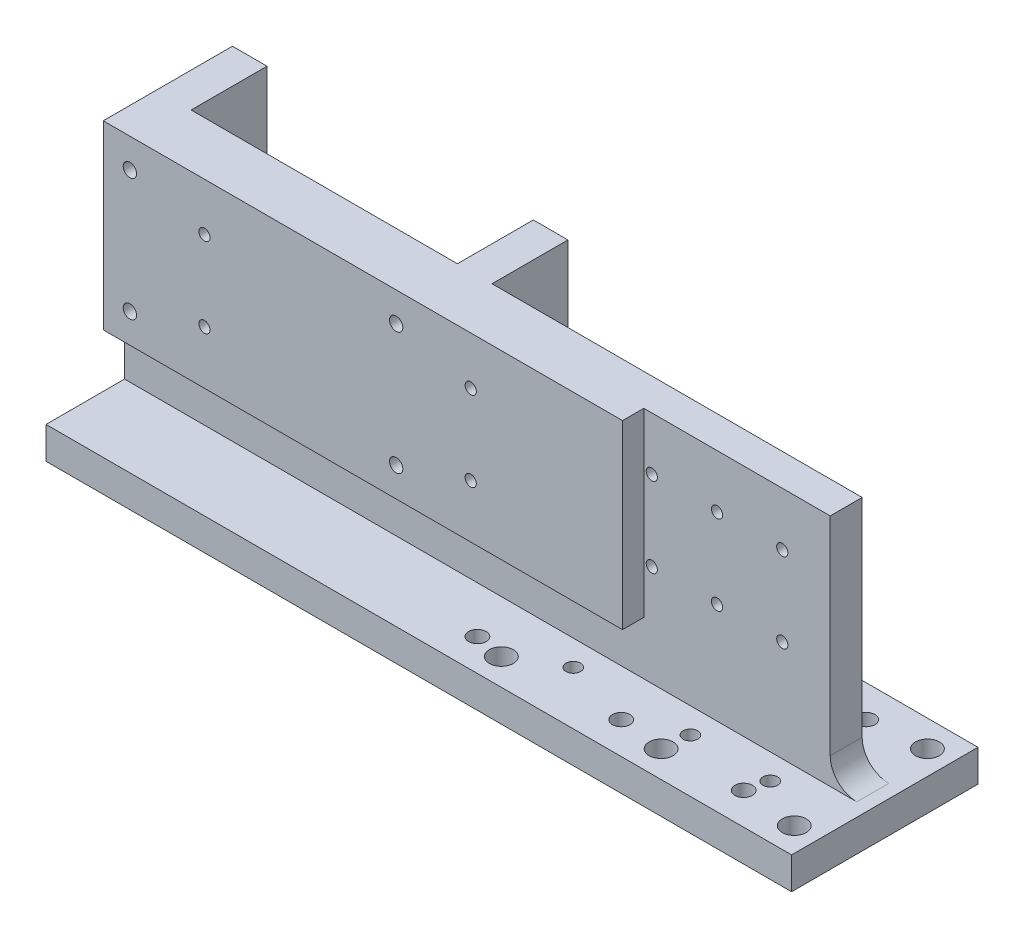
ISO-10303-21;
HEADER;
FILE_DESCRIPTION(('STEP AP214'),'2;1');
FILE_NAME('part.step','',(''),(''),'','','');
FILE_SCHEMA(('AUTOMOTIVE_DESIGN { 1 0 10303 214 1 1 1 1 }'));
ENDSEC;
DATA;
#1=APPLICATION_CONTEXT('core data for automotive mechanical design processes');
#2=APPLICATION_PROTOCOL_DEFINITION('international standard','automotive_design',2000,#1);
#3=PRODUCT_CONTEXT('',#1,'mechanical');
#4=PRODUCT('Part','Part','',(#3));
#5=PRODUCT_RELATED_PRODUCT_CATEGORY('part','',(#4));
#6=PRODUCT_DEFINITION_FORMATION('','',#4);
#7=PRODUCT_DEFINITION_CONTEXT('part definition',#1,'design');
#8=PRODUCT_DEFINITION('design','',#6,#7);
#9=PRODUCT_DEFINITION_SHAPE('','',#8);
#10=(LENGTH_UNIT() NAMED_UNIT(*) SI_UNIT(.MILLI.,.METRE.));
#11=(NAMED_UNIT(*) PLANE_ANGLE_UNIT() SI_UNIT($,.RADIAN.));
#12=(NAMED_UNIT(*) SI_UNIT($,.STERADIAN.) SOLID_ANGLE_UNIT());
#13=UNCERTAINTY_MEASURE_WITH_UNIT(LENGTH_MEASURE(1.E-05),#10,'distance_accuracy_value','');
#14=(GEOMETRIC_REPRESENTATION_CONTEXT(3) GLOBAL_UNCERTAINTY_ASSIGNED_CONTEXT((#13)) GLOBAL_UNIT_ASSIGNED_CONTEXT((#10,
#11,#12)) REPRESENTATION_CONTEXT('',''));
#15=CARTESIAN_POINT('',(0.,0.,0.));
#16=DIRECTION('',(0.,0.,1.));
#17=DIRECTION('',(1.,0.,0.));
#18=AXIS2_PLACEMENT_3D('',#15,#16,#17);
#19=CARTESIAN_POINT('',(0.,12.,0.));
#20=DIRECTION('',(0.,1.,0.));
#21=DIRECTION('',(0.,0.,1.));
#22=AXIS2_PLACEMENT_3D('',#19,#20,#21);
#23=PLANE('',#22);
#24=DIRECTION('',(-1.,0.,0.));
#25=VECTOR('',#24,1.);
#26=CARTESIAN_POINT('',(140.,12.,-35.));
#27=LINE('',#26,#25);
#28=CARTESIAN_POINT('',(-39.7,12.,-35.));
#29=VERTEX_POINT('',#28);
#30=CARTESIAN_POINT('',(-114.3,12.,-35.));
#31=VERTEX_POINT('',#30);
#32=EDGE_CURVE('E484',#29,#31,#27,.T.);
#33=ORIENTED_EDGE('',*,*,#32,.T.);
#34=DIRECTION('',(0.,0.,-1.));
#35=VECTOR('',#34,1.);
#36=CARTESIAN_POINT('',(-114.3,12.,0.));
#37=LINE('',#36,#35);
#38=CARTESIAN_POINT('',(-114.3,12.,-6.49999999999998));
#39=VERTEX_POINT('',#38);
#40=EDGE_CURVE('E512',#31,#39,#37,.F.);
#41=ORIENTED_EDGE('',*,*,#40,.T.);
#42=DIRECTION('',(-1.,0.,0.));
#43=VECTOR('',#42,1.);
#44=CARTESIAN_POINT('',(-27.,12.,-6.49999999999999));
#45=LINE('',#44,#43);
#46=CARTESIAN_POINT('',(-39.7,12.,-6.49999999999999));
#47=VERTEX_POINT('',#46);
#48=EDGE_CURVE('E430',#47,#39,#45,.T.);
#49=ORIENTED_EDGE('',*,*,#48,.F.);
#50=DIRECTION('',(0.,0.,1.));
#51=VECTOR('',#50,1.);
#52=CARTESIAN_POINT('',(-39.7,12.,0.));
#53=LINE('',#52,#51);
#54=EDGE_CURVE('E510',#47,#29,#53,.F.);
#55=ORIENTED_EDGE('',*,*,#54,.T.);
#56=EDGE_LOOP('',(#33,#41,#49,#55));
#57=FACE_BOUND('',#56,.T.);
#58=ADVANCED_FACE('F40',(#57),#23,.T.);
#59=CARTESIAN_POINT('',(-140.,12.,35.));
#60=DIRECTION('',(1.,0.,0.));
#61=DIRECTION('',(0.,0.,-1.));
#62=AXIS2_PLACEMENT_3D('',#59,#60,#61);
#63=PLANE('',#62);
#64=DIRECTION('',(0.,0.,1.));
#65=VECTOR('',#64,1.);
#66=CARTESIAN_POINT('',(-140.,12.,35.));
#67=LINE('',#66,#65);
#68=CARTESIAN_POINT('',(-140.,12.,5.50000000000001));
#69=VERTEX_POINT('',#68);
#70=CARTESIAN_POINT('',(-140.,12.,35.));
#71=VERTEX_POINT('',#70);
#72=EDGE_CURVE('E477',#69,#71,#67,.T.);
#73=ORIENTED_EDGE('',*,*,#72,.F.);
#74=DIRECTION('',(0.,-1.,0.));
#75=VECTOR('',#74,1.);
#76=CARTESIAN_POINT('',(-140.,12.,5.50000000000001));
#77=LINE('',#76,#75);
#78=CARTESIAN_POINT('',(-140.,32.,5.50000000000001));
#79=VERTEX_POINT('',#78);
#80=EDGE_CURVE('E403',#79,#69,#77,.T.);
#81=ORIENTED_EDGE('',*,*,#80,.F.);
#82=DIRECTION('',(0.,0.,1.));
#83=VECTOR('',#82,1.);
#84=CARTESIAN_POINT('',(-140.,32.,-190.522957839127));
#85=LINE('',#84,#83);
#86=CARTESIAN_POINT('',(-140.,32.,13.5));
#87=VERTEX_POINT('',#86);
#88=EDGE_CURVE('E406',#79,#87,#85,.T.);
#89=ORIENTED_EDGE('',*,*,#88,.T.);
#90=DIRECTION('',(0.,-1.,0.));
#91=VECTOR('',#90,1.);
#92=CARTESIAN_POINT('',(-140.,100.,13.5));
#93=LINE('',#92,#91);
#94=CARTESIAN_POINT('',(-140.,100.,13.5));
#95=VERTEX_POINT('',#94);
#96=EDGE_CURVE('E473',#95,#87,#93,.T.);
#97=ORIENTED_EDGE('',*,*,#96,.F.);
#98=DIRECTION('',(0.,0.,1.));
#99=VECTOR('',#98,1.);
#100=CARTESIAN_POINT('',(-140.,100.,-35.));
#101=LINE('',#100,#99);
#102=CARTESIAN_POINT('',(-140.,100.,-35.));
#103=VERTEX_POINT('',#102);
#104=EDGE_CURVE('E429',#103,#95,#101,.T.);
#105=ORIENTED_EDGE('',*,*,#104,.F.);
#106=DIRECTION('',(0.,-1.,0.));
#107=VECTOR('',#106,1.);
#108=CARTESIAN_POINT('',(-140.,12.,-35.));
#109=LINE('',#108,#107);
#110=CARTESIAN_POINT('',(-140.,0.,-35.));
#111=VERTEX_POINT('',#110);
#112=EDGE_CURVE('E488',#103,#111,#109,.T.);
#113=ORIENTED_EDGE('',*,*,#112,.T.);
#114=DIRECTION('',(0.,0.,1.));
#115=VECTOR('',#114,1.);
#116=CARTESIAN_POINT('',(-140.,0.,35.));
#117=LINE('',#116,#115);
#118=CARTESIAN_POINT('',(-140.,0.,35.));
#119=VERTEX_POINT('',#118);
#120=EDGE_CURVE('E476',#111,#119,#117,.T.);
#121=ORIENTED_EDGE('',*,*,#120,.T.);
#122=DIRECTION('',(0.,-1.,0.));
#123=VECTOR('',#122,1.);
#124=CARTESIAN_POINT('',(-140.,12.,35.));
#125=LINE('',#124,#123);
#126=EDGE_CURVE('E504',#71,#119,#125,.T.);
#127=ORIENTED_EDGE('',*,*,#126,.F.);
#128=EDGE_LOOP('',(#73,#81,#89,#97,#105,#113,#121,#127));
#129=FACE_BOUND('',#128,.T.);
#130=ADVANCED_FACE('F552',(#129),#63,.F.);
#131=CARTESIAN_POINT('',(140.,12.,35.));
#132=DIRECTION('',(0.,0.,-1.));
#133=DIRECTION('',(-1.,0.,0.));
#134=AXIS2_PLACEMENT_3D('',#131,#132,#133);
#135=PLANE('',#134);
#136=DIRECTION('',(1.,0.,0.));
#137=VECTOR('',#136,1.);
#138=CARTESIAN_POINT('',(140.,0.,35.));
#139=LINE('',#138,#137);
#140=CARTESIAN_POINT('',(140.,0.,35.));
#141=VERTEX_POINT('',#140);
#142=EDGE_CURVE('E491',#119,#141,#139,.T.);
#143=ORIENTED_EDGE('',*,*,#142,.T.);
#144=DIRECTION('',(0.,-1.,0.));
#145=VECTOR('',#144,1.);
#146=CARTESIAN_POINT('',(140.,12.,35.));
#147=LINE('',#146,#145);
#148=CARTESIAN_POINT('',(140.,12.,35.));
#149=VERTEX_POINT('',#148);
#150=EDGE_CURVE('E501',#149,#141,#147,.T.);
#151=ORIENTED_EDGE('',*,*,#150,.F.);
#152=DIRECTION('',(1.,0.,0.));
#153=VECTOR('',#152,1.);
#154=CARTESIAN_POINT('',(140.,12.,35.));
#155=LINE('',#154,#153);
#156=EDGE_CURVE('E479',#71,#149,#155,.T.);
#157=ORIENTED_EDGE('',*,*,#156,.F.);
#158=ORIENTED_EDGE('',*,*,#126,.T.);
#159=EDGE_LOOP('',(#143,#151,#157,#158));
#160=FACE_BOUND('',#159,.T.);
#161=ADVANCED_FACE('F557',(#160),#135,.F.);
#162=CARTESIAN_POINT('',(140.,12.,35.));
#163=DIRECTION('',(-1.,0.,0.));
#164=DIRECTION('',(0.,0.,1.));
#165=AXIS2_PLACEMENT_3D('',#162,#163,#164);
#166=PLANE('',#165);
#167=DIRECTION('',(0.,0.,-1.));
#168=VECTOR('',#167,1.);
#169=CARTESIAN_POINT('',(140.,0.,35.));
#170=LINE('',#169,#168);
#171=CARTESIAN_POINT('',(140.,0.,-35.));
#172=VERTEX_POINT('',#171);
#173=EDGE_CURVE('E493',#141,#172,#170,.T.);
#174=ORIENTED_EDGE('',*,*,#173,.T.);
#175=DIRECTION('',(0.,-1.,0.));
#176=VECTOR('',#175,1.);
#177=CARTESIAN_POINT('',(140.,12.,-35.));
#178=LINE('',#177,#176);
#179=CARTESIAN_POINT('',(140.,12.,-35.));
#180=VERTEX_POINT('',#179);
#181=EDGE_CURVE('E498',#180,#172,#178,.T.);
#182=ORIENTED_EDGE('',*,*,#181,.F.);
#183=DIRECTION('',(0.,0.,-1.));
#184=VECTOR('',#183,1.);
#185=CARTESIAN_POINT('',(140.,12.,35.));
#186=LINE('',#185,#184);
#187=EDGE_CURVE('E482',#149,#180,#186,.T.);
#188=ORIENTED_EDGE('',*,*,#187,.F.);
#189=ORIENTED_EDGE('',*,*,#150,.T.);
#190=EDGE_LOOP('',(#174,#182,#188,#189));
#191=FACE_BOUND('',#190,.T.);
#192=ADVANCED_FACE('F564',(#191),#166,.F.);
#193=CARTESIAN_POINT('',(140.,12.,-35.));
#194=DIRECTION('',(0.,0.,1.));
#195=DIRECTION('',(1.,0.,0.));
#196=AXIS2_PLACEMENT_3D('',#193,#194,#195);
#197=PLANE('',#196);
#198=DIRECTION('',(-1.,0.,0.));
#199=VECTOR('',#198,1.);
#200=CARTESIAN_POINT('',(140.,0.,-35.));
#201=LINE('',#200,#199);
#202=EDGE_CURVE('E480',#172,#111,#201,.T.);
#203=ORIENTED_EDGE('',*,*,#202,.T.);
#204=ORIENTED_EDGE('',*,*,#112,.F.);
#205=DIRECTION('',(-1.,0.,0.));
#206=VECTOR('',#205,1.);
#207=CARTESIAN_POINT('',(-127.,100.,-35.));
#208=LINE('',#207,#206);
#209=CARTESIAN_POINT('',(-127.,100.,-35.));
#210=VERTEX_POINT('',#209);
#211=EDGE_CURVE('E426',#210,#103,#208,.T.);
#212=ORIENTED_EDGE('',*,*,#211,.F.);
#213=DIRECTION('',(0.,-1.,0.));
#214=VECTOR('',#213,1.);
#215=CARTESIAN_POINT('',(-127.,100.,-35.));
#216=LINE('',#215,#214);
#217=CARTESIAN_POINT('',(-127.,24.7,-35.));
#218=VERTEX_POINT('',#217);
#219=EDGE_CURVE('E449',#210,#218,#216,.T.);
#220=ORIENTED_EDGE('',*,*,#219,.T.);
#221=CARTESIAN_POINT('',(-114.3,24.7,-35.));
#222=DIRECTION('',(0.,0.,1.));
#223=DIRECTION('',(1.,0.,0.));
#224=AXIS2_PLACEMENT_3D('',#221,#222,#223);
#225=CIRCLE('',#224,12.7);
#226=EDGE_CURVE('E528',#218,#31,#225,.T.);
#227=ORIENTED_EDGE('',*,*,#226,.T.);
#228=ORIENTED_EDGE('',*,*,#32,.F.);
#229=CARTESIAN_POINT('',(-39.7,24.7,-35.));
#230=DIRECTION('',(0.,0.,1.));
#231=DIRECTION('',(1.,0.,0.));
#232=AXIS2_PLACEMENT_3D('',#229,#230,#231);
#233=CIRCLE('',#232,12.7);
#234=CARTESIAN_POINT('',(-27.,24.7,-35.));
#235=VERTEX_POINT('',#234);
#236=EDGE_CURVE('E530',#29,#235,#233,.T.);
#237=ORIENTED_EDGE('',*,*,#236,.T.);
#238=DIRECTION('',(0.,-1.,0.));
#239=VECTOR('',#238,1.);
#240=CARTESIAN_POINT('',(-27.,100.,-35.));
#241=LINE('',#240,#239);
#242=CARTESIAN_POINT('',(-27.,100.,-35.));
#243=VERTEX_POINT('',#242);
#244=EDGE_CURVE('E461',#243,#235,#241,.T.);
#245=ORIENTED_EDGE('',*,*,#244,.F.);
#246=DIRECTION('',(-1.,0.,0.));
#247=VECTOR('',#246,1.);
#248=CARTESIAN_POINT('',(-14.,100.,-35.));
#249=LINE('',#248,#247);
#250=CARTESIAN_POINT('',(-14.,100.,-35.));
#251=VERTEX_POINT('',#250);
#252=EDGE_CURVE('E441',#251,#243,#249,.T.);
#253=ORIENTED_EDGE('',*,*,#252,.F.);
#254=DIRECTION('',(0.,-1.,0.));
#255=VECTOR('',#254,1.);
#256=CARTESIAN_POINT('',(-14.,100.,-35.));
#257=LINE('',#256,#255);
#258=CARTESIAN_POINT('',(-14.,24.7,-35.));
#259=VERTEX_POINT('',#258);
#260=EDGE_CURVE('E464',#251,#259,#257,.T.);
#261=ORIENTED_EDGE('',*,*,#260,.T.);
#262=CARTESIAN_POINT('',(-1.30000000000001,24.7,-35.));
#263=DIRECTION('',(0.,0.,1.));
#264=DIRECTION('',(1.,0.,0.));
#265=AXIS2_PLACEMENT_3D('',#262,#263,#264);
#266=CIRCLE('',#265,12.7);
#267=CARTESIAN_POINT('',(-1.30000000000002,12.,-35.));
#268=VERTEX_POINT('',#267);
#269=EDGE_CURVE('E532',#259,#268,#266,.T.);
#270=ORIENTED_EDGE('',*,*,#269,.T.);
#271=EDGE_CURVE('E485',#180,#268,#27,.T.);
#272=ORIENTED_EDGE('',*,*,#271,.F.);
#273=ORIENTED_EDGE('',*,*,#181,.T.);
#274=EDGE_LOOP('',(#203,#204,#212,#220,#227,#228,#237,#245,#253,#261,#270,#272,#273));
#275=FACE_BOUND('',#274,.T.);
#276=ADVANCED_FACE('F568',(#275),#197,.F.);
#277=CARTESIAN_POINT('',(112.,12.,-15.));
#278=DIRECTION('',(0.,1.,0.));
#279=DIRECTION('',(0.,0.,1.));
#280=AXIS2_PLACEMENT_3D('',#277,#278,#279);
#281=CIRCLE('',#280,2.74999999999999);
#282=CARTESIAN_POINT('',(112.,12.,-12.25));
#283=VERTEX_POINT('',#282);
#284=EDGE_CURVE('E292',#283,#283,#281,.T.);
#285=ORIENTED_EDGE('',*,*,#284,.F.);
#286=EDGE_LOOP('',(#285));
#287=FACE_BOUND('',#286,.T.);
#288=CARTESIAN_POINT('',(112.,12.,15.));
#289=DIRECTION('',(0.,1.,0.));
#290=DIRECTION('',(0.,0.,1.));
#291=AXIS2_PLACEMENT_3D('',#288,#289,#290);
#292=CIRCLE('',#291,2.74999999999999);
#293=CARTESIAN_POINT('',(112.,12.,17.75));
#294=VERTEX_POINT('',#293);
#295=EDGE_CURVE('E298',#294,#294,#292,.T.);
#296=ORIENTED_EDGE('',*,*,#295,.F.);
#297=EDGE_LOOP('',(#296));
#298=FACE_BOUND('',#297,.T.);
#299=CARTESIAN_POINT('',(82.,12.,-15.));
#300=DIRECTION('',(0.,1.,0.));
#301=DIRECTION('',(0.,0.,1.));
#302=AXIS2_PLACEMENT_3D('',#299,#300,#301);
#303=CIRCLE('',#302,2.74999999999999);
#304=CARTESIAN_POINT('',(82.,12.,-12.25));
#305=VERTEX_POINT('',#304);
#306=EDGE_CURVE('E304',#305,#305,#303,.T.);
#307=ORIENTED_EDGE('',*,*,#306,.F.);
#308=EDGE_LOOP('',(#307));
#309=FACE_BOUND('',#308,.T.);
#310=CARTESIAN_POINT('',(82.,12.,15.));
#311=DIRECTION('',(0.,1.,0.));
#312=DIRECTION('',(0.,0.,1.));
#313=AXIS2_PLACEMENT_3D('',#310,#311,#312);
#314=CIRCLE('',#313,2.74999999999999);
#315=CARTESIAN_POINT('',(82.,12.,17.75));
#316=VERTEX_POINT('',#315);
#317=EDGE_CURVE('E310',#316,#316,#314,.T.);
#318=ORIENTED_EDGE('',*,*,#317,.F.);
#319=EDGE_LOOP('',(#318));
#320=FACE_BOUND('',#319,.T.);
#321=CARTESIAN_POINT('',(38.,12.,-15.));
#322=DIRECTION('',(0.,1.,0.));
#323=DIRECTION('',(0.,0.,1.));
#324=AXIS2_PLACEMENT_3D('',#321,#322,#323);
#325=CIRCLE('',#324,2.74999999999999);
#326=CARTESIAN_POINT('',(38.,12.,-12.25));
#327=VERTEX_POINT('',#326);
#328=EDGE_CURVE('E316',#327,#327,#325,.T.);
#329=ORIENTED_EDGE('',*,*,#328,.F.);
#330=EDGE_LOOP('',(#329));
#331=FACE_BOUND('',#330,.T.);
#332=CARTESIAN_POINT('',(38.,12.,15.));
#333=DIRECTION('',(0.,1.,0.));
#334=DIRECTION('',(0.,0.,1.));
#335=AXIS2_PLACEMENT_3D('',#332,#333,#334);
#336=CIRCLE('',#335,2.74999999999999);
#337=CARTESIAN_POINT('',(38.,12.,17.75));
#338=VERTEX_POINT('',#337);
#339=EDGE_CURVE('E322',#338,#338,#336,.T.);
#340=ORIENTED_EDGE('',*,*,#339,.F.);
#341=EDGE_LOOP('',(#340));
#342=FACE_BOUND('',#341,.T.);
#343=CARTESIAN_POINT('',(110.,12.,-23.));
#344=DIRECTION('',(0.,1.,0.));
#345=DIRECTION('',(0.,0.,1.));
#346=AXIS2_PLACEMENT_3D('',#343,#344,#345);
#347=CIRCLE('',#346,3.29999999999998);
#348=CARTESIAN_POINT('',(110.,12.,-19.7));
#349=VERTEX_POINT('',#348);
#350=EDGE_CURVE('E328',#349,#349,#347,.T.);
#351=ORIENTED_EDGE('',*,*,#350,.F.);
#352=EDGE_LOOP('',(#351));
#353=FACE_BOUND('',#352,.T.);
#354=CARTESIAN_POINT('',(110.,12.,23.));
#355=DIRECTION('',(0.,1.,0.));
#356=DIRECTION('',(0.,0.,1.));
#357=AXIS2_PLACEMENT_3D('',#354,#355,#356);
#358=CIRCLE('',#357,3.29999999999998);
#359=CARTESIAN_POINT('',(110.,12.,26.3));
#360=VERTEX_POINT('',#359);
#361=EDGE_CURVE('E334',#360,#360,#358,.T.);
#362=ORIENTED_EDGE('',*,*,#361,.F.);
#363=EDGE_LOOP('',(#362));
#364=FACE_BOUND('',#363,.T.);
#365=CARTESIAN_POINT('',(64.,12.,-23.));
#366=DIRECTION('',(0.,1.,0.));
#367=DIRECTION('',(0.,0.,1.));
#368=AXIS2_PLACEMENT_3D('',#365,#366,#367);
#369=CIRCLE('',#368,3.29999999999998);
#370=CARTESIAN_POINT('',(64.,12.,-19.7));
#371=VERTEX_POINT('',#370);
#372=EDGE_CURVE('E340',#371,#371,#369,.T.);
#373=ORIENTED_EDGE('',*,*,#372,.F.);
#374=EDGE_LOOP('',(#373));
#375=FACE_BOUND('',#374,.T.);
#376=CARTESIAN_POINT('',(64.,12.,23.));
#377=DIRECTION('',(0.,1.,0.));
#378=DIRECTION('',(0.,0.,1.));
#379=AXIS2_PLACEMENT_3D('',#376,#377,#378);
#380=CIRCLE('',#379,3.29999999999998);
#381=CARTESIAN_POINT('',(64.,12.,26.3));
#382=VERTEX_POINT('',#381);
#383=EDGE_CURVE('E346',#382,#382,#380,.T.);
#384=ORIENTED_EDGE('',*,*,#383,.F.);
#385=EDGE_LOOP('',(#384));
#386=FACE_BOUND('',#385,.T.);
#387=CARTESIAN_POINT('',(9.99999999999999,12.,-23.));
#388=DIRECTION('',(0.,1.,0.));
#389=DIRECTION('',(0.,0.,1.));
#390=AXIS2_PLACEMENT_3D('',#387,#388,#389);
#391=CIRCLE('',#390,3.29999999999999);
#392=CARTESIAN_POINT('',(9.99999999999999,12.,-19.7));
#393=VERTEX_POINT('',#392);
#394=EDGE_CURVE('E352',#393,#393,#391,.T.);
#395=ORIENTED_EDGE('',*,*,#394,.F.);
#396=EDGE_LOOP('',(#395));
#397=FACE_BOUND('',#396,.T.);
#398=CARTESIAN_POINT('',(9.99999999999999,12.,23.));
#399=DIRECTION('',(0.,1.,0.));
#400=DIRECTION('',(0.,0.,1.));
#401=AXIS2_PLACEMENT_3D('',#398,#399,#400);
#402=CIRCLE('',#401,3.29999999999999);
#403=CARTESIAN_POINT('',(9.99999999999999,12.,26.3));
#404=VERTEX_POINT('',#403);
#405=EDGE_CURVE('E358',#404,#404,#402,.T.);
#406=ORIENTED_EDGE('',*,*,#405,.F.);
#407=EDGE_LOOP('',(#406));
#408=FACE_BOUND('',#407,.T.);
#409=CARTESIAN_POINT('',(131.,12.,-25.));
#410=DIRECTION('',(0.,1.,0.));
#411=DIRECTION('',(0.,0.,1.));
#412=AXIS2_PLACEMENT_3D('',#409,#410,#411);
#413=CIRCLE('',#412,4.49999999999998);
#414=CARTESIAN_POINT('',(131.,12.,-20.5));
#415=VERTEX_POINT('',#414);
#416=EDGE_CURVE('E364',#415,#415,#413,.T.);
#417=ORIENTED_EDGE('',*,*,#416,.F.);
#418=EDGE_LOOP('',(#417));
#419=FACE_BOUND('',#418,.T.);
#420=CARTESIAN_POINT('',(81.,12.,-25.));
#421=DIRECTION('',(0.,1.,0.));
#422=DIRECTION('',(0.,0.,1.));
#423=AXIS2_PLACEMENT_3D('',#420,#421,#422);
#424=CIRCLE('',#423,4.49999999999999);
#425=CARTESIAN_POINT('',(81.,12.,-20.5));
#426=VERTEX_POINT('',#425);
#427=EDGE_CURVE('E370',#426,#426,#424,.T.);
#428=ORIENTED_EDGE('',*,*,#427,.F.);
#429=EDGE_LOOP('',(#428));
#430=FACE_BOUND('',#429,.T.);
#431=CARTESIAN_POINT('',(21.,12.,-25.));
#432=DIRECTION('',(0.,1.,0.));
#433=DIRECTION('',(0.,0.,1.));
#434=AXIS2_PLACEMENT_3D('',#431,#432,#433);
#435=CIRCLE('',#434,4.49999999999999);
#436=CARTESIAN_POINT('',(21.,12.,-20.5));
#437=VERTEX_POINT('',#436);
#438=EDGE_CURVE('E376',#437,#437,#435,.T.);
#439=ORIENTED_EDGE('',*,*,#438,.F.);
#440=EDGE_LOOP('',(#439));
#441=FACE_BOUND('',#440,.T.);
#442=CARTESIAN_POINT('',(21.,12.,25.));
#443=DIRECTION('',(0.,1.,0.));
#444=DIRECTION('',(0.,0.,1.));
#445=AXIS2_PLACEMENT_3D('',#442,#443,#444);
#446=CIRCLE('',#445,4.49999999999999);
#447=CARTESIAN_POINT('',(21.,12.,29.5));
#448=VERTEX_POINT('',#447);
#449=EDGE_CURVE('E382',#448,#448,#446,.T.);
#450=ORIENTED_EDGE('',*,*,#449,.F.);
#451=EDGE_LOOP('',(#450));
#452=FACE_BOUND('',#451,.T.);
#453=CARTESIAN_POINT('',(81.,12.,25.));
#454=DIRECTION('',(0.,1.,0.));
#455=DIRECTION('',(0.,0.,1.));
#456=AXIS2_PLACEMENT_3D('',#453,#454,#455);
#457=CIRCLE('',#456,4.49999999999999);
#458=CARTESIAN_POINT('',(81.,12.,29.5));
#459=VERTEX_POINT('',#458);
#460=EDGE_CURVE('E388',#459,#459,#457,.T.);
#461=ORIENTED_EDGE('',*,*,#460,.F.);
#462=EDGE_LOOP('',(#461));
#463=FACE_BOUND('',#462,.T.);
#464=CARTESIAN_POINT('',(131.,12.,25.));
#465=DIRECTION('',(0.,1.,0.));
#466=DIRECTION('',(0.,0.,1.));
#467=AXIS2_PLACEMENT_3D('',#464,#465,#466);
#468=CIRCLE('',#467,4.49999999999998);
#469=CARTESIAN_POINT('',(131.,12.,29.5));
#470=VERTEX_POINT('',#469);
#471=EDGE_CURVE('E394',#470,#470,#468,.T.);
#472=ORIENTED_EDGE('',*,*,#471,.F.);
#473=EDGE_LOOP('',(#472));
#474=FACE_BOUND('',#473,.T.);
#475=DIRECTION('',(-1.,0.,0.));
#476=VECTOR('',#475,1.);
#477=CARTESIAN_POINT('',(125.,12.,-6.50000000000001));
#478=LINE('',#477,#476);
#479=CARTESIAN_POINT('',(135.,12.,-6.50000000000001));
#480=VERTEX_POINT('',#479);
#481=CARTESIAN_POINT('',(-1.30000000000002,12.,-6.49999999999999));
#482=VERTEX_POINT('',#481);
#483=EDGE_CURVE('E55',#480,#482,#478,.T.);
#484=ORIENTED_EDGE('',*,*,#483,.F.);
#485=DIRECTION('',(0.,0.,-1.));
#486=VECTOR('',#485,1.);
#487=CARTESIAN_POINT('',(135.,12.,0.));
#488=LINE('',#487,#486);
#489=CARTESIAN_POINT('',(135.,12.,5.50000000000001));
#490=VERTEX_POINT('',#489);
#491=EDGE_CURVE('E537',#480,#490,#488,.F.);
#492=ORIENTED_EDGE('',*,*,#491,.T.);
#493=DIRECTION('',(1.,0.,0.));
#494=VECTOR('',#493,1.);
#495=CARTESIAN_POINT('',(125.,12.,5.50000000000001));
#496=LINE('',#495,#494);
#497=EDGE_CURVE('E62',#69,#490,#496,.T.);
#498=ORIENTED_EDGE('',*,*,#497,.F.);
#499=ORIENTED_EDGE('',*,*,#72,.T.);
#500=ORIENTED_EDGE('',*,*,#156,.T.);
#501=ORIENTED_EDGE('',*,*,#187,.T.);
#502=ORIENTED_EDGE('',*,*,#271,.T.);
#503=DIRECTION('',(0.,0.,-1.));
#504=VECTOR('',#503,1.);
#505=CARTESIAN_POINT('',(-1.30000000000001,12.,0.));
#506=LINE('',#505,#504);
#507=EDGE_CURVE('E524',#268,#482,#506,.F.);
#508=ORIENTED_EDGE('',*,*,#507,.T.);
#509=EDGE_LOOP('',(#484,#492,#498,#499,#500,#501,#502,#508));
#510=FACE_BOUND('',#509,.T.);
#511=ADVANCED_FACE('F547',(#287,#298,#309,#320,#331,#342,#353,#364,#375,#386,#397,#408,#419,
#430,#441,#452,#463,#474,#510),#23,.T.);
#512=CARTESIAN_POINT('',(0.,0.,0.));
#513=DIRECTION('',(0.,1.,0.));
#514=DIRECTION('',(0.,0.,1.));
#515=AXIS2_PLACEMENT_3D('',#512,#513,#514);
#516=PLANE('',#515);
#517=CARTESIAN_POINT('',(112.,0.,-15.));
#518=DIRECTION('',(0.,1.,0.));
#519=DIRECTION('',(0.,0.,1.));
#520=AXIS2_PLACEMENT_3D('',#517,#518,#519);
#521=CIRCLE('',#520,2.74999999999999);
#522=CARTESIAN_POINT('',(112.,0.,-12.25));
#523=VERTEX_POINT('',#522);
#524=EDGE_CURVE('E295',#523,#523,#521,.T.);
#525=ORIENTED_EDGE('',*,*,#524,.T.);
#526=EDGE_LOOP('',(#525));
#527=FACE_BOUND('',#526,.T.);
#528=CARTESIAN_POINT('',(112.,0.,15.));
#529=DIRECTION('',(0.,1.,0.));
#530=DIRECTION('',(0.,0.,1.));
#531=AXIS2_PLACEMENT_3D('',#528,#529,#530);
#532=CIRCLE('',#531,2.74999999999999);
#533=CARTESIAN_POINT('',(112.,0.,17.75));
#534=VERTEX_POINT('',#533);
#535=EDGE_CURVE('E301',#534,#534,#532,.T.);
#536=ORIENTED_EDGE('',*,*,#535,.T.);
#537=EDGE_LOOP('',(#536));
#538=FACE_BOUND('',#537,.T.);
#539=CARTESIAN_POINT('',(82.,0.,-15.));
#540=DIRECTION('',(0.,1.,0.));
#541=DIRECTION('',(0.,0.,1.));
#542=AXIS2_PLACEMENT_3D('',#539,#540,#541);
#543=CIRCLE('',#542,2.74999999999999);
#544=CARTESIAN_POINT('',(82.,0.,-12.25));
#545=VERTEX_POINT('',#544);
#546=EDGE_CURVE('E307',#545,#545,#543,.T.);
#547=ORIENTED_EDGE('',*,*,#546,.T.);
#548=EDGE_LOOP('',(#547));
#549=FACE_BOUND('',#548,.T.);
#550=CARTESIAN_POINT('',(82.,0.,15.));
#551=DIRECTION('',(0.,1.,0.));
#552=DIRECTION('',(0.,0.,1.));
#553=AXIS2_PLACEMENT_3D('',#550,#551,#552);
#554=CIRCLE('',#553,2.74999999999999);
#555=CARTESIAN_POINT('',(82.,0.,17.75));
#556=VERTEX_POINT('',#555);
#557=EDGE_CURVE('E313',#556,#556,#554,.T.);
#558=ORIENTED_EDGE('',*,*,#557,.T.);
#559=EDGE_LOOP('',(#558));
#560=FACE_BOUND('',#559,.T.);
#561=CARTESIAN_POINT('',(38.,0.,-15.));
#562=DIRECTION('',(0.,1.,0.));
#563=DIRECTION('',(0.,0.,1.));
#564=AXIS2_PLACEMENT_3D('',#561,#562,#563);
#565=CIRCLE('',#564,2.74999999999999);
#566=CARTESIAN_POINT('',(38.,0.,-12.25));
#567=VERTEX_POINT('',#566);
#568=EDGE_CURVE('E319',#567,#567,#565,.T.);
#569=ORIENTED_EDGE('',*,*,#568,.T.);
#570=EDGE_LOOP('',(#569));
#571=FACE_BOUND('',#570,.T.);
#572=CARTESIAN_POINT('',(38.,0.,15.));
#573=DIRECTION('',(0.,1.,0.));
#574=DIRECTION('',(0.,0.,1.));
#575=AXIS2_PLACEMENT_3D('',#572,#573,#574);
#576=CIRCLE('',#575,2.74999999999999);
#577=CARTESIAN_POINT('',(38.,0.,17.75));
#578=VERTEX_POINT('',#577);
#579=EDGE_CURVE('E325',#578,#578,#576,.T.);
#580=ORIENTED_EDGE('',*,*,#579,.T.);
#581=EDGE_LOOP('',(#580));
#582=FACE_BOUND('',#581,.T.);
#583=CARTESIAN_POINT('',(110.,0.,-23.));
#584=DIRECTION('',(0.,1.,0.));
#585=DIRECTION('',(0.,0.,1.));
#586=AXIS2_PLACEMENT_3D('',#583,#584,#585);
#587=CIRCLE('',#586,3.29999999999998);
#588=CARTESIAN_POINT('',(110.,0.,-19.7));
#589=VERTEX_POINT('',#588);
#590=EDGE_CURVE('E331',#589,#589,#587,.T.);
#591=ORIENTED_EDGE('',*,*,#590,.T.);
#592=EDGE_LOOP('',(#591));
#593=FACE_BOUND('',#592,.T.);
#594=CARTESIAN_POINT('',(110.,0.,23.));
#595=DIRECTION('',(0.,1.,0.));
#596=DIRECTION('',(0.,0.,1.));
#597=AXIS2_PLACEMENT_3D('',#594,#595,#596);
#598=CIRCLE('',#597,3.29999999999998);
#599=CARTESIAN_POINT('',(110.,0.,26.3));
#600=VERTEX_POINT('',#599);
#601=EDGE_CURVE('E337',#600,#600,#598,.T.);
#602=ORIENTED_EDGE('',*,*,#601,.T.);
#603=EDGE_LOOP('',(#602));
#604=FACE_BOUND('',#603,.T.);
#605=CARTESIAN_POINT('',(64.,0.,-23.));
#606=DIRECTION('',(0.,1.,0.));
#607=DIRECTION('',(0.,0.,1.));
#608=AXIS2_PLACEMENT_3D('',#605,#606,#607);
#609=CIRCLE('',#608,3.29999999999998);
#610=CARTESIAN_POINT('',(64.,0.,-19.7));
#611=VERTEX_POINT('',#610);
#612=EDGE_CURVE('E343',#611,#611,#609,.T.);
#613=ORIENTED_EDGE('',*,*,#612,.T.);
#614=EDGE_LOOP('',(#613));
#615=FACE_BOUND('',#614,.T.);
#616=CARTESIAN_POINT('',(64.,0.,23.));
#617=DIRECTION('',(0.,1.,0.));
#618=DIRECTION('',(0.,0.,1.));
#619=AXIS2_PLACEMENT_3D('',#616,#617,#618);
#620=CIRCLE('',#619,3.29999999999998);
#621=CARTESIAN_POINT('',(64.,0.,26.3));
#622=VERTEX_POINT('',#621);
#623=EDGE_CURVE('E349',#622,#622,#620,.T.);
#624=ORIENTED_EDGE('',*,*,#623,.T.);
#625=EDGE_LOOP('',(#624));
#626=FACE_BOUND('',#625,.T.);
#627=CARTESIAN_POINT('',(9.99999999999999,0.,-23.));
#628=DIRECTION('',(0.,1.,0.));
#629=DIRECTION('',(0.,0.,1.));
#630=AXIS2_PLACEMENT_3D('',#627,#628,#629);
#631=CIRCLE('',#630,3.29999999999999);
#632=CARTESIAN_POINT('',(9.99999999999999,0.,-19.7));
#633=VERTEX_POINT('',#632);
#634=EDGE_CURVE('E355',#633,#633,#631,.T.);
#635=ORIENTED_EDGE('',*,*,#634,.T.);
#636=EDGE_LOOP('',(#635));
#637=FACE_BOUND('',#636,.T.);
#638=CARTESIAN_POINT('',(9.99999999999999,0.,23.));
#639=DIRECTION('',(0.,1.,0.));
#640=DIRECTION('',(0.,0.,1.));
#641=AXIS2_PLACEMENT_3D('',#638,#639,#640);
#642=CIRCLE('',#641,3.29999999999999);
#643=CARTESIAN_POINT('',(9.99999999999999,0.,26.3));
#644=VERTEX_POINT('',#643);
#645=EDGE_CURVE('E361',#644,#644,#642,.T.);
#646=ORIENTED_EDGE('',*,*,#645,.T.);
#647=EDGE_LOOP('',(#646));
#648=FACE_BOUND('',#647,.T.);
#649=CARTESIAN_POINT('',(131.,0.,-25.));
#650=DIRECTION('',(0.,1.,0.));
#651=DIRECTION('',(0.,0.,1.));
#652=AXIS2_PLACEMENT_3D('',#649,#650,#651);
#653=CIRCLE('',#652,4.49999999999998);
#654=CARTESIAN_POINT('',(131.,0.,-20.5));
#655=VERTEX_POINT('',#654);
#656=EDGE_CURVE('E367',#655,#655,#653,.T.);
#657=ORIENTED_EDGE('',*,*,#656,.T.);
#658=EDGE_LOOP('',(#657));
#659=FACE_BOUND('',#658,.T.);
#660=CARTESIAN_POINT('',(81.,0.,-25.));
#661=DIRECTION('',(0.,1.,0.));
#662=DIRECTION('',(0.,0.,1.));
#663=AXIS2_PLACEMENT_3D('',#660,#661,#662);
#664=CIRCLE('',#663,4.49999999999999);
#665=CARTESIAN_POINT('',(81.,0.,-20.5));
#666=VERTEX_POINT('',#665);
#667=EDGE_CURVE('E373',#666,#666,#664,.T.);
#668=ORIENTED_EDGE('',*,*,#667,.T.);
#669=EDGE_LOOP('',(#668));
#670=FACE_BOUND('',#669,.T.);
#671=CARTESIAN_POINT('',(21.,0.,-25.));
#672=DIRECTION('',(0.,1.,0.));
#673=DIRECTION('',(0.,0.,1.));
#674=AXIS2_PLACEMENT_3D('',#671,#672,#673);
#675=CIRCLE('',#674,4.49999999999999);
#676=CARTESIAN_POINT('',(21.,0.,-20.5));
#677=VERTEX_POINT('',#676);
#678=EDGE_CURVE('E379',#677,#677,#675,.T.);
#679=ORIENTED_EDGE('',*,*,#678,.T.);
#680=EDGE_LOOP('',(#679));
#681=FACE_BOUND('',#680,.T.);
#682=CARTESIAN_POINT('',(21.,0.,25.));
#683=DIRECTION('',(0.,1.,0.));
#684=DIRECTION('',(0.,0.,1.));
#685=AXIS2_PLACEMENT_3D('',#682,#683,#684);
#686=CIRCLE('',#685,4.49999999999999);
#687=CARTESIAN_POINT('',(21.,0.,29.5));
#688=VERTEX_POINT('',#687);
#689=EDGE_CURVE('E385',#688,#688,#686,.T.);
#690=ORIENTED_EDGE('',*,*,#689,.T.);
#691=EDGE_LOOP('',(#690));
#692=FACE_BOUND('',#691,.T.);
#693=CARTESIAN_POINT('',(81.,0.,25.));
#694=DIRECTION('',(0.,1.,0.));
#695=DIRECTION('',(0.,0.,1.));
#696=AXIS2_PLACEMENT_3D('',#693,#694,#695);
#697=CIRCLE('',#696,4.49999999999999);
#698=CARTESIAN_POINT('',(81.,0.,29.5));
#699=VERTEX_POINT('',#698);
#700=EDGE_CURVE('E391',#699,#699,#697,.T.);
#701=ORIENTED_EDGE('',*,*,#700,.T.);
#702=EDGE_LOOP('',(#701));
#703=FACE_BOUND('',#702,.T.);
#704=CARTESIAN_POINT('',(131.,0.,25.));
#705=DIRECTION('',(0.,1.,0.));
#706=DIRECTION('',(0.,0.,1.));
#707=AXIS2_PLACEMENT_3D('',#704,#705,#706);
#708=CIRCLE('',#707,4.49999999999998);
#709=CARTESIAN_POINT('',(131.,0.,29.5));
#710=VERTEX_POINT('',#709);
#711=EDGE_CURVE('E397',#710,#710,#708,.T.);
#712=ORIENTED_EDGE('',*,*,#711,.T.);
#713=EDGE_LOOP('',(#712));
#714=FACE_BOUND('',#713,.T.);
#715=ORIENTED_EDGE('',*,*,#120,.F.);
#716=ORIENTED_EDGE('',*,*,#202,.F.);
#717=ORIENTED_EDGE('',*,*,#173,.F.);
#718=ORIENTED_EDGE('',*,*,#142,.F.);
#719=EDGE_LOOP('',(#715,#716,#717,#718));
#720=FACE_BOUND('',#719,.T.);
#721=ADVANCED_FACE('F617',(#527,#538,#549,#560,#571,#582,#593,#604,#615,#626,#637,#648,#659,
#670,#681,#692,#703,#714,#720),#516,.F.);
#722=CARTESIAN_POINT('',(-140.,100.,13.5));
#723=DIRECTION('',(0.,0.,-1.));
#724=DIRECTION('',(-1.,0.,0.));
#725=AXIS2_PLACEMENT_3D('',#722,#723,#724);
#726=PLANE('',#725);
#727=CARTESIAN_POINT('',(-102.,82.,13.5));
#728=DIRECTION('',(0.,0.,1.));
#729=DIRECTION('',(1.,0.,0.));
#730=AXIS2_PLACEMENT_3D('',#727,#728,#729);
#731=CIRCLE('',#730,2.09999999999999);
#732=CARTESIAN_POINT('',(-99.9,82.,13.5));
#733=VERTEX_POINT('',#732);
#734=EDGE_CURVE('E210',#733,#733,#731,.T.);
#735=ORIENTED_EDGE('',*,*,#734,.F.);
#736=EDGE_LOOP('',(#735));
#737=FACE_BOUND('',#736,.T.);
#738=CARTESIAN_POINT('',(-102.,52.,13.5));
#739=DIRECTION('',(0.,0.,1.));
#740=DIRECTION('',(1.,0.,0.));
#741=AXIS2_PLACEMENT_3D('',#738,#739,#740);
#742=CIRCLE('',#741,2.09999999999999);
#743=CARTESIAN_POINT('',(-99.9,52.,13.5));
#744=VERTEX_POINT('',#743);
#745=EDGE_CURVE('E209',#744,#744,#742,.T.);
#746=ORIENTED_EDGE('',*,*,#745,.F.);
#747=EDGE_LOOP('',(#746));
#748=FACE_BOUND('',#747,.T.);
#749=CARTESIAN_POINT('',(-2.,82.,13.5));
#750=DIRECTION('',(0.,0.,1.));
#751=DIRECTION('',(1.,0.,0.));
#752=AXIS2_PLACEMENT_3D('',#749,#750,#751);
#753=CIRCLE('',#752,2.09999999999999);
#754=CARTESIAN_POINT('',(0.0999999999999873,82.,13.5));
#755=VERTEX_POINT('',#754);
#756=EDGE_CURVE('E220',#755,#755,#753,.T.);
#757=ORIENTED_EDGE('',*,*,#756,.F.);
#758=EDGE_LOOP('',(#757));
#759=FACE_BOUND('',#758,.T.);
#760=CARTESIAN_POINT('',(-2.,52.,13.5));
#761=DIRECTION('',(0.,0.,1.));
#762=DIRECTION('',(1.,0.,0.));
#763=AXIS2_PLACEMENT_3D('',#760,#761,#762);
#764=CIRCLE('',#763,2.09999999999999);
#765=CARTESIAN_POINT('',(0.0999999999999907,52.,13.5));
#766=VERTEX_POINT('',#765);
#767=EDGE_CURVE('E226',#766,#766,#764,.T.);
#768=ORIENTED_EDGE('',*,*,#767,.F.);
#769=EDGE_LOOP('',(#768));
#770=FACE_BOUND('',#769,.T.);
#771=CARTESIAN_POINT('',(-130.,89.,13.5));
#772=DIRECTION('',(0.,0.,1.));
#773=DIRECTION('',(1.,0.,0.));
#774=AXIS2_PLACEMENT_3D('',#771,#772,#773);
#775=CIRCLE('',#774,2.5);
#776=CARTESIAN_POINT('',(-127.5,89.,13.5));
#777=VERTEX_POINT('',#776);
#778=EDGE_CURVE('E268',#777,#777,#775,.T.);
#779=ORIENTED_EDGE('',*,*,#778,.F.);
#780=EDGE_LOOP('',(#779));
#781=FACE_BOUND('',#780,.T.);
#782=CARTESIAN_POINT('',(-130.,43.,13.5));
#783=DIRECTION('',(0.,0.,1.));
#784=DIRECTION('',(1.,0.,0.));
#785=AXIS2_PLACEMENT_3D('',#782,#783,#784);
#786=CIRCLE('',#785,2.5);
#787=CARTESIAN_POINT('',(-127.5,43.,13.5));
#788=VERTEX_POINT('',#787);
#789=EDGE_CURVE('E274',#788,#788,#786,.T.);
#790=ORIENTED_EDGE('',*,*,#789,.F.);
#791=EDGE_LOOP('',(#790));
#792=FACE_BOUND('',#791,.T.);
#793=CARTESIAN_POINT('',(-29.9999999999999,89.,13.5));
#794=DIRECTION('',(0.,0.,1.));
#795=DIRECTION('',(1.,0.,0.));
#796=AXIS2_PLACEMENT_3D('',#793,#794,#795);
#797=CIRCLE('',#796,2.49999999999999);
#798=CARTESIAN_POINT('',(-27.4999999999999,89.,13.5));
#799=VERTEX_POINT('',#798);
#800=EDGE_CURVE('E280',#799,#799,#797,.T.);
#801=ORIENTED_EDGE('',*,*,#800,.F.);
#802=EDGE_LOOP('',(#801));
#803=FACE_BOUND('',#802,.T.);
#804=CARTESIAN_POINT('',(-29.9999999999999,43.,13.5));
#805=DIRECTION('',(0.,0.,1.));
#806=DIRECTION('',(1.,0.,0.));
#807=AXIS2_PLACEMENT_3D('',#804,#805,#806);
#808=CIRCLE('',#807,2.49999999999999);
#809=CARTESIAN_POINT('',(-27.4999999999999,43.,13.5));
#810=VERTEX_POINT('',#809);
#811=EDGE_CURVE('E286',#810,#810,#808,.T.);
#812=ORIENTED_EDGE('',*,*,#811,.F.);
#813=EDGE_LOOP('',(#812));
#814=FACE_BOUND('',#813,.T.);
#815=ORIENTED_EDGE('',*,*,#96,.T.);
#816=DIRECTION('',(-1.,0.,0.));
#817=VECTOR('',#816,1.);
#818=CARTESIAN_POINT('',(-140.,32.,13.5));
#819=LINE('',#818,#817);
#820=CARTESIAN_POINT('',(55.,32.,13.5));
#821=VERTEX_POINT('',#820);
#822=EDGE_CURVE('E400',#821,#87,#819,.T.);
#823=ORIENTED_EDGE('',*,*,#822,.F.);
#824=DIRECTION('',(0.,-1.,0.));
#825=VECTOR('',#824,1.);
#826=CARTESIAN_POINT('',(55.,100.,13.5));
#827=LINE('',#826,#825);
#828=CARTESIAN_POINT('',(55.,100.,13.5));
#829=VERTEX_POINT('',#828);
#830=EDGE_CURVE('E405',#829,#821,#827,.T.);
#831=ORIENTED_EDGE('',*,*,#830,.F.);
#832=DIRECTION('',(1.,0.,0.));
#833=VECTOR('',#832,1.);
#834=CARTESIAN_POINT('',(-140.,100.,13.5));
#835=LINE('',#834,#833);
#836=EDGE_CURVE('E432',#95,#829,#835,.T.);
#837=ORIENTED_EDGE('',*,*,#836,.F.);
#838=EDGE_LOOP('',(#815,#823,#831,#837));
#839=FACE_BOUND('',#838,.T.);
#840=ADVANCED_FACE('F593',(#737,#748,#759,#770,#781,#792,#803,#814,#839),#726,.F.);
#841=CARTESIAN_POINT('',(125.,100.,13.5));
#842=DIRECTION('',(-1.,0.,0.));
#843=DIRECTION('',(0.,0.,1.));
#844=AXIS2_PLACEMENT_3D('',#841,#842,#843);
#845=PLANE('',#844);
#846=DIRECTION('',(0.,1.,0.));
#847=VECTOR('',#846,1.);
#848=CARTESIAN_POINT('',(125.,100.,5.50000000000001));
#849=LINE('',#848,#847);
#850=CARTESIAN_POINT('',(125.,22.,5.50000000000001));
#851=VERTEX_POINT('',#850);
#852=CARTESIAN_POINT('',(125.,100.,5.50000000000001));
#853=VERTEX_POINT('',#852);
#854=EDGE_CURVE('E413',#851,#853,#849,.T.);
#855=ORIENTED_EDGE('',*,*,#854,.F.);
#856=DIRECTION('',(0.,0.,-1.));
#857=VECTOR('',#856,1.);
#858=CARTESIAN_POINT('',(125.,22.,13.5));
#859=LINE('',#858,#857);
#860=CARTESIAN_POINT('',(125.,22.,-6.50000000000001));
#861=VERTEX_POINT('',#860);
#862=EDGE_CURVE('E534',#851,#861,#859,.T.);
#863=ORIENTED_EDGE('',*,*,#862,.T.);
#864=DIRECTION('',(0.,-1.,0.));
#865=VECTOR('',#864,1.);
#866=CARTESIAN_POINT('',(125.,100.,-6.50000000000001));
#867=LINE('',#866,#865);
#868=CARTESIAN_POINT('',(125.,100.,-6.50000000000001));
#869=VERTEX_POINT('',#868);
#870=EDGE_CURVE('E470',#869,#861,#867,.T.);
#871=ORIENTED_EDGE('',*,*,#870,.F.);
#872=DIRECTION('',(0.,0.,-1.));
#873=VECTOR('',#872,1.);
#874=CARTESIAN_POINT('',(125.,100.,13.5));
#875=LINE('',#874,#873);
#876=EDGE_CURVE('E435',#853,#869,#875,.T.);
#877=ORIENTED_EDGE('',*,*,#876,.F.);
#878=EDGE_LOOP('',(#855,#863,#871,#877));
#879=FACE_BOUND('',#878,.T.);
#880=ADVANCED_FACE('F585',(#879),#845,.F.);
#881=CARTESIAN_POINT('',(125.,100.,-6.50000000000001));
#882=DIRECTION('',(0.,0.,1.));
#883=DIRECTION('',(1.,0.,0.));
#884=AXIS2_PLACEMENT_3D('',#881,#882,#883);
#885=PLANE('',#884);
#886=CARTESIAN_POINT('',(107.,80.,-6.50000000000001));
#887=DIRECTION('',(0.,0.,1.));
#888=DIRECTION('',(1.,0.,0.));
#889=AXIS2_PLACEMENT_3D('',#886,#887,#888);
#890=CIRCLE('',#889,2.09999999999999);
#891=CARTESIAN_POINT('',(109.1,80.,-6.50000000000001));
#892=VERTEX_POINT('',#891);
#893=EDGE_CURVE('E235',#892,#892,#890,.T.);
#894=ORIENTED_EDGE('',*,*,#893,.T.);
#895=EDGE_LOOP('',(#894));
#896=FACE_BOUND('',#895,.T.);
#897=CARTESIAN_POINT('',(82.5,80.,-6.5));
#898=DIRECTION('',(0.,0.,1.));
#899=DIRECTION('',(1.,0.,0.));
#900=AXIS2_PLACEMENT_3D('',#897,#898,#899);
#901=CIRCLE('',#900,2.09999999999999);
#902=CARTESIAN_POINT('',(84.6,80.,-6.5));
#903=VERTEX_POINT('',#902);
#904=EDGE_CURVE('E241',#903,#903,#901,.T.);
#905=ORIENTED_EDGE('',*,*,#904,.T.);
#906=EDGE_LOOP('',(#905));
#907=FACE_BOUND('',#906,.T.);
#908=CARTESIAN_POINT('',(58.,80.,-6.5));
#909=DIRECTION('',(0.,0.,1.));
#910=DIRECTION('',(1.,0.,0.));
#911=AXIS2_PLACEMENT_3D('',#908,#909,#910);
#912=CIRCLE('',#911,2.09999999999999);
#913=CARTESIAN_POINT('',(60.1,80.,-6.5));
#914=VERTEX_POINT('',#913);
#915=EDGE_CURVE('E247',#914,#914,#912,.T.);
#916=ORIENTED_EDGE('',*,*,#915,.T.);
#917=EDGE_LOOP('',(#916));
#918=FACE_BOUND('',#917,.T.);
#919=CARTESIAN_POINT('',(58.0000000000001,50.,-6.5));
#920=DIRECTION('',(0.,0.,1.));
#921=DIRECTION('',(1.,0.,0.));
#922=AXIS2_PLACEMENT_3D('',#919,#920,#921);
#923=CIRCLE('',#922,2.09999999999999);
#924=CARTESIAN_POINT('',(60.1,50.,-6.5));
#925=VERTEX_POINT('',#924);
#926=EDGE_CURVE('E253',#925,#925,#923,.T.);
#927=ORIENTED_EDGE('',*,*,#926,.T.);
#928=EDGE_LOOP('',(#927));
#929=FACE_BOUND('',#928,.T.);
#930=CARTESIAN_POINT('',(82.5,50.,-6.5));
#931=DIRECTION('',(0.,0.,1.));
#932=DIRECTION('',(1.,0.,0.));
#933=AXIS2_PLACEMENT_3D('',#930,#931,#932);
#934=CIRCLE('',#933,2.09999999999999);
#935=CARTESIAN_POINT('',(84.6,50.,-6.5));
#936=VERTEX_POINT('',#935);
#937=EDGE_CURVE('E259',#936,#936,#934,.T.);
#938=ORIENTED_EDGE('',*,*,#937,.T.);
#939=EDGE_LOOP('',(#938));
#940=FACE_BOUND('',#939,.T.);
#941=CARTESIAN_POINT('',(107.,50.,-6.50000000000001));
#942=DIRECTION('',(0.,0.,1.));
#943=DIRECTION('',(1.,0.,0.));
#944=AXIS2_PLACEMENT_3D('',#941,#942,#943);
#945=CIRCLE('',#944,2.09999999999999);
#946=CARTESIAN_POINT('',(109.1,50.,-6.50000000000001));
#947=VERTEX_POINT('',#946);
#948=EDGE_CURVE('E265',#947,#947,#945,.T.);
#949=ORIENTED_EDGE('',*,*,#948,.T.);
#950=EDGE_LOOP('',(#949));
#951=FACE_BOUND('',#950,.T.);
#952=ORIENTED_EDGE('',*,*,#483,.T.);
#953=CARTESIAN_POINT('',(-1.30000000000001,24.7,-6.49999999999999));
#954=DIRECTION('',(0.,0.,1.));
#955=DIRECTION('',(1.,0.,0.));
#956=AXIS2_PLACEMENT_3D('',#953,#954,#955);
#957=CIRCLE('',#956,12.7);
#958=CARTESIAN_POINT('',(-14.,24.7,-6.49999999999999));
#959=VERTEX_POINT('',#958);
#960=EDGE_CURVE('E526',#482,#959,#957,.F.);
#961=ORIENTED_EDGE('',*,*,#960,.T.);
#962=DIRECTION('',(0.,-1.,0.));
#963=VECTOR('',#962,1.);
#964=CARTESIAN_POINT('',(-14.,100.,-6.49999999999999));
#965=LINE('',#964,#963);
#966=CARTESIAN_POINT('',(-14.,100.,-6.49999999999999));
#967=VERTEX_POINT('',#966);
#968=EDGE_CURVE('E467',#967,#959,#965,.T.);
#969=ORIENTED_EDGE('',*,*,#968,.F.);
#970=DIRECTION('',(-1.,0.,0.));
#971=VECTOR('',#970,1.);
#972=CARTESIAN_POINT('',(125.,100.,-6.50000000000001));
#973=LINE('',#972,#971);
#974=EDGE_CURVE('E437',#869,#967,#973,.T.);
#975=ORIENTED_EDGE('',*,*,#974,.F.);
#976=ORIENTED_EDGE('',*,*,#870,.T.);
#977=CARTESIAN_POINT('',(135.,22.,-6.50000000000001));
#978=DIRECTION('',(0.,0.,1.));
#979=DIRECTION('',(1.,0.,0.));
#980=AXIS2_PLACEMENT_3D('',#977,#978,#979);
#981=CIRCLE('',#980,10.);
#982=EDGE_CURVE('E48',#861,#480,#981,.T.);
#983=ORIENTED_EDGE('',*,*,#982,.T.);
#984=EDGE_LOOP('',(#952,#961,#969,#975,#976,#983));
#985=FACE_BOUND('',#984,.T.);
#986=ADVANCED_FACE('F540',(#896,#907,#918,#929,#940,#951,#985),#885,.F.);
#987=CARTESIAN_POINT('',(-14.,100.,-6.49999999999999));
#988=DIRECTION('',(-1.,0.,0.));
#989=DIRECTION('',(0.,0.,1.));
#990=AXIS2_PLACEMENT_3D('',#987,#988,#989);
#991=PLANE('',#990);
#992=ORIENTED_EDGE('',*,*,#968,.T.);
#993=DIRECTION('',(0.,0.,-1.));
#994=VECTOR('',#993,1.);
#995=CARTESIAN_POINT('',(-14.,24.7,-6.49999999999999));
#996=LINE('',#995,#994);
#997=EDGE_CURVE('E521',#959,#259,#996,.T.);
#998=ORIENTED_EDGE('',*,*,#997,.T.);
#999=ORIENTED_EDGE('',*,*,#260,.F.);
#1000=DIRECTION('',(0.,0.,-1.));
#1001=VECTOR('',#1000,1.);
#1002=CARTESIAN_POINT('',(-14.,100.,-6.49999999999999));
#1003=LINE('',#1002,#1001);
#1004=EDGE_CURVE('E439',#967,#251,#1003,.T.);
#1005=ORIENTED_EDGE('',*,*,#1004,.F.);
#1006=EDGE_LOOP('',(#992,#998,#999,#1005));
#1007=FACE_BOUND('',#1006,.T.);
#1008=ADVANCED_FACE('F575',(#1007),#991,.F.);
#1009=CARTESIAN_POINT('',(-27.,100.,-35.));
#1010=DIRECTION('',(1.,0.,0.));
#1011=DIRECTION('',(0.,0.,-1.));
#1012=AXIS2_PLACEMENT_3D('',#1009,#1010,#1011);
#1013=PLANE('',#1012);
#1014=ORIENTED_EDGE('',*,*,#244,.T.);
#1015=DIRECTION('',(0.,0.,1.));
#1016=VECTOR('',#1015,1.);
#1017=CARTESIAN_POINT('',(-27.,24.7,-35.));
#1018=LINE('',#1017,#1016);
#1019=CARTESIAN_POINT('',(-27.,24.7,-6.49999999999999));
#1020=VERTEX_POINT('',#1019);
#1021=EDGE_CURVE('E518',#235,#1020,#1018,.T.);
#1022=ORIENTED_EDGE('',*,*,#1021,.T.);
#1023=DIRECTION('',(0.,-1.,0.));
#1024=VECTOR('',#1023,1.);
#1025=CARTESIAN_POINT('',(-27.,100.,-6.49999999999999));
#1026=LINE('',#1025,#1024);
#1027=CARTESIAN_POINT('',(-27.,100.,-6.49999999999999));
#1028=VERTEX_POINT('',#1027);
#1029=EDGE_CURVE('E458',#1028,#1020,#1026,.T.);
#1030=ORIENTED_EDGE('',*,*,#1029,.F.);
#1031=DIRECTION('',(0.,0.,1.));
#1032=VECTOR('',#1031,1.);
#1033=CARTESIAN_POINT('',(-27.,100.,-35.));
#1034=LINE('',#1033,#1032);
#1035=EDGE_CURVE('E443',#243,#1028,#1034,.T.);
#1036=ORIENTED_EDGE('',*,*,#1035,.F.);
#1037=EDGE_LOOP('',(#1014,#1022,#1030,#1036));
#1038=FACE_BOUND('',#1037,.T.);
#1039=ADVANCED_FACE('F852',(#1038),#1013,.F.);
#1040=CARTESIAN_POINT('',(-27.,100.,-6.49999999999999));
#1041=DIRECTION('',(0.,0.,1.));
#1042=DIRECTION('',(1.,0.,0.));
#1043=AXIS2_PLACEMENT_3D('',#1040,#1041,#1042);
#1044=PLANE('',#1043);
#1045=ORIENTED_EDGE('',*,*,#48,.T.);
#1046=CARTESIAN_POINT('',(-114.3,24.7,-6.49999999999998));
#1047=DIRECTION('',(0.,0.,1.));
#1048=DIRECTION('',(1.,0.,0.));
#1049=AXIS2_PLACEMENT_3D('',#1046,#1047,#1048);
#1050=CIRCLE('',#1049,12.7);
#1051=CARTESIAN_POINT('',(-127.,24.7,-6.49999999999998));
#1052=VERTEX_POINT('',#1051);
#1053=EDGE_CURVE('E516',#39,#1052,#1050,.F.);
#1054=ORIENTED_EDGE('',*,*,#1053,.T.);
#1055=DIRECTION('',(0.,-1.,0.));
#1056=VECTOR('',#1055,1.);
#1057=CARTESIAN_POINT('',(-127.,100.,-6.49999999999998));
#1058=LINE('',#1057,#1056);
#1059=CARTESIAN_POINT('',(-127.,100.,-6.49999999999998));
#1060=VERTEX_POINT('',#1059);
#1061=EDGE_CURVE('E455',#1060,#1052,#1058,.T.);
#1062=ORIENTED_EDGE('',*,*,#1061,.F.);
#1063=DIRECTION('',(-1.,0.,0.));
#1064=VECTOR('',#1063,1.);
#1065=CARTESIAN_POINT('',(-27.,100.,-6.49999999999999));
#1066=LINE('',#1065,#1064);
#1067=EDGE_CURVE('E445',#1028,#1060,#1066,.T.);
#1068=ORIENTED_EDGE('',*,*,#1067,.F.);
#1069=ORIENTED_EDGE('',*,*,#1029,.T.);
#1070=CARTESIAN_POINT('',(-39.7,24.7,-6.49999999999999));
#1071=DIRECTION('',(0.,0.,1.));
#1072=DIRECTION('',(1.,0.,0.));
#1073=AXIS2_PLACEMENT_3D('',#1070,#1071,#1072);
#1074=CIRCLE('',#1073,12.7);
#1075=EDGE_CURVE('E514',#1020,#47,#1074,.F.);
#1076=ORIENTED_EDGE('',*,*,#1075,.T.);
#1077=EDGE_LOOP('',(#1045,#1054,#1062,#1068,#1069,#1076));
#1078=FACE_BOUND('',#1077,.T.);
#1079=ADVANCED_FACE('F855',(#1078),#1044,.F.);
#1080=CARTESIAN_POINT('',(-127.,100.,-6.49999999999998));
#1081=DIRECTION('',(-1.,0.,0.));
#1082=DIRECTION('',(0.,0.,1.));
#1083=AXIS2_PLACEMENT_3D('',#1080,#1081,#1082);
#1084=PLANE('',#1083);
#1085=ORIENTED_EDGE('',*,*,#1061,.T.);
#1086=DIRECTION('',(0.,0.,-1.));
#1087=VECTOR('',#1086,1.);
#1088=CARTESIAN_POINT('',(-127.,24.7,-6.49999999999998));
#1089=LINE('',#1088,#1087);
#1090=EDGE_CURVE('E507',#1052,#218,#1089,.T.);
#1091=ORIENTED_EDGE('',*,*,#1090,.T.);
#1092=ORIENTED_EDGE('',*,*,#219,.F.);
#1093=DIRECTION('',(0.,0.,-1.));
#1094=VECTOR('',#1093,1.);
#1095=CARTESIAN_POINT('',(-127.,100.,-6.49999999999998));
#1096=LINE('',#1095,#1094);
#1097=EDGE_CURVE('E447',#1060,#210,#1096,.T.);
#1098=ORIENTED_EDGE('',*,*,#1097,.F.);
#1099=EDGE_LOOP('',(#1085,#1091,#1092,#1098));
#1100=FACE_BOUND('',#1099,.T.);
#1101=ADVANCED_FACE('F859',(#1100),#1084,.F.);
#1102=CARTESIAN_POINT('',(0.,100.,0.));
#1103=DIRECTION('',(0.,1.,0.));
#1104=DIRECTION('',(0.,0.,1.));
#1105=AXIS2_PLACEMENT_3D('',#1102,#1103,#1104);
#1106=PLANE('',#1105);
#1107=DIRECTION('',(0.,0.,1.));
#1108=VECTOR('',#1107,1.);
#1109=CARTESIAN_POINT('',(55.,100.,5.50000000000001));
#1110=LINE('',#1109,#1108);
#1111=CARTESIAN_POINT('',(55.,100.,5.50000000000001));
#1112=VERTEX_POINT('',#1111);
#1113=EDGE_CURVE('E422',#1112,#829,#1110,.T.);
#1114=ORIENTED_EDGE('',*,*,#1113,.F.);
#1115=DIRECTION('',(-1.,0.,0.));
#1116=VECTOR('',#1115,1.);
#1117=CARTESIAN_POINT('',(125.,100.,5.50000000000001));
#1118=LINE('',#1117,#1116);
#1119=EDGE_CURVE('E415',#853,#1112,#1118,.T.);
#1120=ORIENTED_EDGE('',*,*,#1119,.F.);
#1121=ORIENTED_EDGE('',*,*,#876,.T.);
#1122=ORIENTED_EDGE('',*,*,#974,.T.);
#1123=ORIENTED_EDGE('',*,*,#1004,.T.);
#1124=ORIENTED_EDGE('',*,*,#252,.T.);
#1125=ORIENTED_EDGE('',*,*,#1035,.T.);
#1126=ORIENTED_EDGE('',*,*,#1067,.T.);
#1127=ORIENTED_EDGE('',*,*,#1097,.T.);
#1128=ORIENTED_EDGE('',*,*,#211,.T.);
#1129=ORIENTED_EDGE('',*,*,#104,.T.);
#1130=ORIENTED_EDGE('',*,*,#836,.T.);
#1131=EDGE_LOOP('',(#1114,#1120,#1121,#1122,#1123,#1124,#1125,#1126,#1127,#1128,#1129,#1130));
#1132=FACE_BOUND('',#1131,.T.);
#1133=ADVANCED_FACE('F580',(#1132),#1106,.T.);
#1134=CARTESIAN_POINT('',(-114.3,24.7,-6.49999999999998));
#1135=DIRECTION('',(0.,0.,-1.));
#1136=DIRECTION('',(-1.,0.,0.));
#1137=AXIS2_PLACEMENT_3D('',#1134,#1135,#1136);
#1138=CYLINDRICAL_SURFACE('',#1137,12.7);
#1139=ORIENTED_EDGE('',*,*,#1053,.F.);
#1140=ORIENTED_EDGE('',*,*,#40,.F.);
#1141=ORIENTED_EDGE('',*,*,#226,.F.);
#1142=ORIENTED_EDGE('',*,*,#1090,.F.);
#1143=EDGE_LOOP('',(#1139,#1140,#1141,#1142));
#1144=FACE_BOUND('',#1143,.T.);
#1145=ADVANCED_FACE('F866',(#1144),#1138,.F.);
#1146=CARTESIAN_POINT('',(-39.7,24.7,-35.));
#1147=DIRECTION('',(0.,0.,1.));
#1148=DIRECTION('',(1.,0.,0.));
#1149=AXIS2_PLACEMENT_3D('',#1146,#1147,#1148);
#1150=CYLINDRICAL_SURFACE('',#1149,12.7);
#1151=ORIENTED_EDGE('',*,*,#236,.F.);
#1152=ORIENTED_EDGE('',*,*,#54,.F.);
#1153=ORIENTED_EDGE('',*,*,#1075,.F.);
#1154=ORIENTED_EDGE('',*,*,#1021,.F.);
#1155=EDGE_LOOP('',(#1151,#1152,#1153,#1154));
#1156=FACE_BOUND('',#1155,.T.);
#1157=ADVANCED_FACE('F871',(#1156),#1150,.F.);
#1158=CARTESIAN_POINT('',(-1.30000000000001,24.7,-6.49999999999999));
#1159=DIRECTION('',(0.,0.,-1.));
#1160=DIRECTION('',(-1.,0.,0.));
#1161=AXIS2_PLACEMENT_3D('',#1158,#1159,#1160);
#1162=CYLINDRICAL_SURFACE('',#1161,12.7);
#1163=ORIENTED_EDGE('',*,*,#960,.F.);
#1164=ORIENTED_EDGE('',*,*,#507,.F.);
#1165=ORIENTED_EDGE('',*,*,#269,.F.);
#1166=ORIENTED_EDGE('',*,*,#997,.F.);
#1167=EDGE_LOOP('',(#1163,#1164,#1165,#1166));
#1168=FACE_BOUND('',#1167,.T.);
#1169=ADVANCED_FACE('F573',(#1168),#1162,.F.);
#1170=CARTESIAN_POINT('',(55.,100.,5.50000000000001));
#1171=DIRECTION('',(-1.,0.,0.));
#1172=DIRECTION('',(0.,0.,1.));
#1173=AXIS2_PLACEMENT_3D('',#1170,#1171,#1172);
#1174=PLANE('',#1173);
#1175=ORIENTED_EDGE('',*,*,#830,.T.);
#1176=DIRECTION('',(0.,0.,1.));
#1177=VECTOR('',#1176,1.);
#1178=CARTESIAN_POINT('',(55.,32.,-190.522957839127));
#1179=LINE('',#1178,#1177);
#1180=CARTESIAN_POINT('',(55.,32.,5.50000000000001));
#1181=VERTEX_POINT('',#1180);
#1182=EDGE_CURVE('E402',#1181,#821,#1179,.T.);
#1183=ORIENTED_EDGE('',*,*,#1182,.F.);
#1184=DIRECTION('',(0.,-1.,0.));
#1185=VECTOR('',#1184,1.);
#1186=CARTESIAN_POINT('',(55.,100.,5.50000000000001));
#1187=LINE('',#1186,#1185);
#1188=EDGE_CURVE('E418',#1112,#1181,#1187,.T.);
#1189=ORIENTED_EDGE('',*,*,#1188,.F.);
#1190=ORIENTED_EDGE('',*,*,#1113,.T.);
#1191=EDGE_LOOP('',(#1175,#1183,#1189,#1190));
#1192=FACE_BOUND('',#1191,.T.);
#1193=ADVANCED_FACE('F589',(#1192),#1174,.F.);
#1194=CARTESIAN_POINT('',(0.,0.,5.50000000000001));
#1195=DIRECTION('',(0.,0.,-1.));
#1196=DIRECTION('',(-1.,0.,0.));
#1197=AXIS2_PLACEMENT_3D('',#1194,#1195,#1196);
#1198=PLANE('',#1197);
#1199=CARTESIAN_POINT('',(107.,80.,5.50000000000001));
#1200=DIRECTION('',(0.,0.,1.));
#1201=DIRECTION('',(1.,0.,0.));
#1202=AXIS2_PLACEMENT_3D('',#1199,#1200,#1201);
#1203=CIRCLE('',#1202,2.09999999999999);
#1204=CARTESIAN_POINT('',(109.1,80.,5.50000000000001));
#1205=VERTEX_POINT('',#1204);
#1206=EDGE_CURVE('E232',#1205,#1205,#1203,.T.);
#1207=ORIENTED_EDGE('',*,*,#1206,.F.);
#1208=EDGE_LOOP('',(#1207));
#1209=FACE_BOUND('',#1208,.T.);
#1210=CARTESIAN_POINT('',(82.5,80.,5.50000000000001));
#1211=DIRECTION('',(0.,0.,1.));
#1212=DIRECTION('',(1.,0.,0.));
#1213=AXIS2_PLACEMENT_3D('',#1210,#1211,#1212);
#1214=CIRCLE('',#1213,2.09999999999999);
#1215=CARTESIAN_POINT('',(84.6,80.,5.50000000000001));
#1216=VERTEX_POINT('',#1215);
#1217=EDGE_CURVE('E238',#1216,#1216,#1214,.T.);
#1218=ORIENTED_EDGE('',*,*,#1217,.F.);
#1219=EDGE_LOOP('',(#1218));
#1220=FACE_BOUND('',#1219,.T.);
#1221=CARTESIAN_POINT('',(58.,80.,5.50000000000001));
#1222=DIRECTION('',(0.,0.,1.));
#1223=DIRECTION('',(1.,0.,0.));
#1224=AXIS2_PLACEMENT_3D('',#1221,#1222,#1223);
#1225=CIRCLE('',#1224,2.09999999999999);
#1226=CARTESIAN_POINT('',(60.1,80.,5.50000000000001));
#1227=VERTEX_POINT('',#1226);
#1228=EDGE_CURVE('E244',#1227,#1227,#1225,.T.);
#1229=ORIENTED_EDGE('',*,*,#1228,.F.);
#1230=EDGE_LOOP('',(#1229));
#1231=FACE_BOUND('',#1230,.T.);
#1232=CARTESIAN_POINT('',(58.0000000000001,50.,5.50000000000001));
#1233=DIRECTION('',(0.,0.,1.));
#1234=DIRECTION('',(1.,0.,0.));
#1235=AXIS2_PLACEMENT_3D('',#1232,#1233,#1234);
#1236=CIRCLE('',#1235,2.09999999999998);
#1237=CARTESIAN_POINT('',(60.1,50.,5.50000000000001));
#1238=VERTEX_POINT('',#1237);
#1239=EDGE_CURVE('E250',#1238,#1238,#1236,.T.);
#1240=ORIENTED_EDGE('',*,*,#1239,.F.);
#1241=EDGE_LOOP('',(#1240));
#1242=FACE_BOUND('',#1241,.T.);
#1243=CARTESIAN_POINT('',(82.5,50.,5.50000000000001));
#1244=DIRECTION('',(0.,0.,1.));
#1245=DIRECTION('',(1.,0.,0.));
#1246=AXIS2_PLACEMENT_3D('',#1243,#1244,#1245);
#1247=CIRCLE('',#1246,2.09999999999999);
#1248=CARTESIAN_POINT('',(84.6,50.,5.50000000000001));
#1249=VERTEX_POINT('',#1248);
#1250=EDGE_CURVE('E256',#1249,#1249,#1247,.T.);
#1251=ORIENTED_EDGE('',*,*,#1250,.F.);
#1252=EDGE_LOOP('',(#1251));
#1253=FACE_BOUND('',#1252,.T.);
#1254=CARTESIAN_POINT('',(107.,50.,5.50000000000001));
#1255=DIRECTION('',(0.,0.,1.));
#1256=DIRECTION('',(1.,0.,0.));
#1257=AXIS2_PLACEMENT_3D('',#1254,#1255,#1256);
#1258=CIRCLE('',#1257,2.09999999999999);
#1259=CARTESIAN_POINT('',(109.1,50.,5.50000000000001));
#1260=VERTEX_POINT('',#1259);
#1261=EDGE_CURVE('E262',#1260,#1260,#1258,.T.);
#1262=ORIENTED_EDGE('',*,*,#1261,.F.);
#1263=EDGE_LOOP('',(#1262));
#1264=FACE_BOUND('',#1263,.T.);
#1265=ORIENTED_EDGE('',*,*,#497,.T.);
#1266=CARTESIAN_POINT('',(135.,22.,5.50000000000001));
#1267=DIRECTION('',(0.,0.,-1.));
#1268=DIRECTION('',(-1.,0.,0.));
#1269=AXIS2_PLACEMENT_3D('',#1266,#1267,#1268);
#1270=CIRCLE('',#1269,10.);
#1271=EDGE_CURVE('E11',#490,#851,#1270,.T.);
#1272=ORIENTED_EDGE('',*,*,#1271,.T.);
#1273=ORIENTED_EDGE('',*,*,#854,.T.);
#1274=ORIENTED_EDGE('',*,*,#1119,.T.);
#1275=ORIENTED_EDGE('',*,*,#1188,.T.);
#1276=DIRECTION('',(-1.,0.,0.));
#1277=VECTOR('',#1276,1.);
#1278=CARTESIAN_POINT('',(-140.,32.,5.50000000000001));
#1279=LINE('',#1278,#1277);
#1280=EDGE_CURVE('E407',#1181,#79,#1279,.T.);
#1281=ORIENTED_EDGE('',*,*,#1280,.T.);
#1282=ORIENTED_EDGE('',*,*,#80,.T.);
#1283=EDGE_LOOP('',(#1265,#1272,#1273,#1274,#1275,#1281,#1282));
#1284=FACE_BOUND('',#1283,.T.);
#1285=ADVANCED_FACE('F550',(#1209,#1220,#1231,#1242,#1253,#1264,#1284),#1198,.F.);
#1286=CARTESIAN_POINT('',(-140.,32.,-190.522957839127));
#1287=DIRECTION('',(0.,1.,0.));
#1288=DIRECTION('',(0.,0.,1.));
#1289=AXIS2_PLACEMENT_3D('',#1286,#1287,#1288);
#1290=PLANE('',#1289);
#1291=ORIENTED_EDGE('',*,*,#1182,.T.);
#1292=ORIENTED_EDGE('',*,*,#822,.T.);
#1293=ORIENTED_EDGE('',*,*,#88,.F.);
#1294=ORIENTED_EDGE('',*,*,#1280,.F.);
#1295=EDGE_LOOP('',(#1291,#1292,#1293,#1294));
#1296=FACE_BOUND('',#1295,.T.);
#1297=ADVANCED_FACE('F595',(#1296),#1290,.F.);
#1298=CARTESIAN_POINT('',(135.,22.,13.5));
#1299=DIRECTION('',(0.,0.,-1.));
#1300=DIRECTION('',(-1.,0.,0.));
#1301=AXIS2_PLACEMENT_3D('',#1298,#1299,#1300);
#1302=CYLINDRICAL_SURFACE('',#1301,10.);
#1303=ORIENTED_EDGE('',*,*,#1271,.F.);
#1304=ORIENTED_EDGE('',*,*,#491,.F.);
#1305=ORIENTED_EDGE('',*,*,#982,.F.);
#1306=ORIENTED_EDGE('',*,*,#862,.F.);
#1307=EDGE_LOOP('',(#1303,#1304,#1305,#1306));
#1308=FACE_BOUND('',#1307,.T.);
#1309=ADVANCED_FACE('F42',(#1308),#1302,.F.);
#1310=CARTESIAN_POINT('',(131.,12.,25.));
#1311=DIRECTION('',(0.,1.,0.));
#1312=DIRECTION('',(0.,0.,1.));
#1313=AXIS2_PLACEMENT_3D('',#1310,#1311,#1312);
#1314=CYLINDRICAL_SURFACE('',#1313,4.49999999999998);
#1315=ORIENTED_EDGE('',*,*,#711,.F.);
#1316=EDGE_LOOP('',(#1315));
#1317=FACE_BOUND('',#1316,.T.);
#1318=ORIENTED_EDGE('',*,*,#471,.T.);
#1319=EDGE_LOOP('',(#1318));
#1320=FACE_BOUND('',#1319,.T.);
#1321=ADVANCED_FACE('F602',(#1317,#1320),#1314,.F.);
#1322=CARTESIAN_POINT('',(81.,12.,25.));
#1323=DIRECTION('',(0.,1.,0.));
#1324=DIRECTION('',(0.,0.,1.));
#1325=AXIS2_PLACEMENT_3D('',#1322,#1323,#1324);
#1326=CYLINDRICAL_SURFACE('',#1325,4.49999999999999);
#1327=ORIENTED_EDGE('',*,*,#700,.F.);
#1328=EDGE_LOOP('',(#1327));
#1329=FACE_BOUND('',#1328,.T.);
#1330=ORIENTED_EDGE('',*,*,#460,.T.);
#1331=EDGE_LOOP('',(#1330));
#1332=FACE_BOUND('',#1331,.T.);
#1333=ADVANCED_FACE('F662',(#1329,#1332),#1326,.F.);
#1334=CARTESIAN_POINT('',(21.,12.,25.));
#1335=DIRECTION('',(0.,1.,0.));
#1336=DIRECTION('',(0.,0.,1.));
#1337=AXIS2_PLACEMENT_3D('',#1334,#1335,#1336);
#1338=CYLINDRICAL_SURFACE('',#1337,4.49999999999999);
#1339=ORIENTED_EDGE('',*,*,#689,.F.);
#1340=EDGE_LOOP('',(#1339));
#1341=FACE_BOUND('',#1340,.T.);
#1342=ORIENTED_EDGE('',*,*,#449,.T.);
#1343=EDGE_LOOP('',(#1342));
#1344=FACE_BOUND('',#1343,.T.);
#1345=ADVANCED_FACE('F667',(#1341,#1344),#1338,.F.);
#1346=CARTESIAN_POINT('',(21.,12.,-25.));
#1347=DIRECTION('',(0.,1.,0.));
#1348=DIRECTION('',(0.,0.,1.));
#1349=AXIS2_PLACEMENT_3D('',#1346,#1347,#1348);
#1350=CYLINDRICAL_SURFACE('',#1349,4.49999999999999);
#1351=ORIENTED_EDGE('',*,*,#678,.F.);
#1352=EDGE_LOOP('',(#1351));
#1353=FACE_BOUND('',#1352,.T.);
#1354=ORIENTED_EDGE('',*,*,#438,.T.);
#1355=EDGE_LOOP('',(#1354));
#1356=FACE_BOUND('',#1355,.T.);
#1357=ADVANCED_FACE('F674',(#1353,#1356),#1350,.F.);
#1358=CARTESIAN_POINT('',(81.,12.,-25.));
#1359=DIRECTION('',(0.,1.,0.));
#1360=DIRECTION('',(0.,0.,1.));
#1361=AXIS2_PLACEMENT_3D('',#1358,#1359,#1360);
#1362=CYLINDRICAL_SURFACE('',#1361,4.49999999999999);
#1363=ORIENTED_EDGE('',*,*,#667,.F.);
#1364=EDGE_LOOP('',(#1363));
#1365=FACE_BOUND('',#1364,.T.);
#1366=ORIENTED_EDGE('',*,*,#427,.T.);
#1367=EDGE_LOOP('',(#1366));
#1368=FACE_BOUND('',#1367,.T.);
#1369=ADVANCED_FACE('F678',(#1365,#1368),#1362,.F.);
#1370=CARTESIAN_POINT('',(131.,12.,-25.));
#1371=DIRECTION('',(0.,1.,0.));
#1372=DIRECTION('',(0.,0.,1.));
#1373=AXIS2_PLACEMENT_3D('',#1370,#1371,#1372);
#1374=CYLINDRICAL_SURFACE('',#1373,4.49999999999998);
#1375=ORIENTED_EDGE('',*,*,#656,.F.);
#1376=EDGE_LOOP('',(#1375));
#1377=FACE_BOUND('',#1376,.T.);
#1378=ORIENTED_EDGE('',*,*,#416,.T.);
#1379=EDGE_LOOP('',(#1378));
#1380=FACE_BOUND('',#1379,.T.);
#1381=ADVANCED_FACE('F682',(#1377,#1380),#1374,.F.);
#1382=CARTESIAN_POINT('',(9.99999999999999,12.,23.));
#1383=DIRECTION('',(0.,1.,0.));
#1384=DIRECTION('',(0.,0.,1.));
#1385=AXIS2_PLACEMENT_3D('',#1382,#1383,#1384);
#1386=CYLINDRICAL_SURFACE('',#1385,3.29999999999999);
#1387=ORIENTED_EDGE('',*,*,#645,.F.);
#1388=EDGE_LOOP('',(#1387));
#1389=FACE_BOUND('',#1388,.T.);
#1390=ORIENTED_EDGE('',*,*,#405,.T.);
#1391=EDGE_LOOP('',(#1390));
#1392=FACE_BOUND('',#1391,.T.);
#1393=ADVANCED_FACE('F686',(#1389,#1392),#1386,.F.);
#1394=CARTESIAN_POINT('',(9.99999999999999,12.,-23.));
#1395=DIRECTION('',(0.,1.,0.));
#1396=DIRECTION('',(0.,0.,1.));
#1397=AXIS2_PLACEMENT_3D('',#1394,#1395,#1396);
#1398=CYLINDRICAL_SURFACE('',#1397,3.29999999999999);
#1399=ORIENTED_EDGE('',*,*,#634,.F.);
#1400=EDGE_LOOP('',(#1399));
#1401=FACE_BOUND('',#1400,.T.);
#1402=ORIENTED_EDGE('',*,*,#394,.T.);
#1403=EDGE_LOOP('',(#1402));
#1404=FACE_BOUND('',#1403,.T.);
#1405=ADVANCED_FACE('F690',(#1401,#1404),#1398,.F.);
#1406=CARTESIAN_POINT('',(64.,12.,23.));
#1407=DIRECTION('',(0.,1.,0.));
#1408=DIRECTION('',(0.,0.,1.));
#1409=AXIS2_PLACEMENT_3D('',#1406,#1407,#1408);
#1410=CYLINDRICAL_SURFACE('',#1409,3.29999999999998);
#1411=ORIENTED_EDGE('',*,*,#623,.F.);
#1412=EDGE_LOOP('',(#1411));
#1413=FACE_BOUND('',#1412,.T.);
#1414=ORIENTED_EDGE('',*,*,#383,.T.);
#1415=EDGE_LOOP('',(#1414));
#1416=FACE_BOUND('',#1415,.T.);
#1417=ADVANCED_FACE('F694',(#1413,#1416),#1410,.F.);
#1418=CARTESIAN_POINT('',(64.,12.,-23.));
#1419=DIRECTION('',(0.,1.,0.));
#1420=DIRECTION('',(0.,0.,1.));
#1421=AXIS2_PLACEMENT_3D('',#1418,#1419,#1420);
#1422=CYLINDRICAL_SURFACE('',#1421,3.29999999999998);
#1423=ORIENTED_EDGE('',*,*,#612,.F.);
#1424=EDGE_LOOP('',(#1423));
#1425=FACE_BOUND('',#1424,.T.);
#1426=ORIENTED_EDGE('',*,*,#372,.T.);
#1427=EDGE_LOOP('',(#1426));
#1428=FACE_BOUND('',#1427,.T.);
#1429=ADVANCED_FACE('F698',(#1425,#1428),#1422,.F.);
#1430=CARTESIAN_POINT('',(110.,12.,23.));
#1431=DIRECTION('',(0.,1.,0.));
#1432=DIRECTION('',(0.,0.,1.));
#1433=AXIS2_PLACEMENT_3D('',#1430,#1431,#1432);
#1434=CYLINDRICAL_SURFACE('',#1433,3.29999999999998);
#1435=ORIENTED_EDGE('',*,*,#601,.F.);
#1436=EDGE_LOOP('',(#1435));
#1437=FACE_BOUND('',#1436,.T.);
#1438=ORIENTED_EDGE('',*,*,#361,.T.);
#1439=EDGE_LOOP('',(#1438));
#1440=FACE_BOUND('',#1439,.T.);
#1441=ADVANCED_FACE('F702',(#1437,#1440),#1434,.F.);
#1442=CARTESIAN_POINT('',(110.,12.,-23.));
#1443=DIRECTION('',(0.,1.,0.));
#1444=DIRECTION('',(0.,0.,1.));
#1445=AXIS2_PLACEMENT_3D('',#1442,#1443,#1444);
#1446=CYLINDRICAL_SURFACE('',#1445,3.29999999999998);
#1447=ORIENTED_EDGE('',*,*,#590,.F.);
#1448=EDGE_LOOP('',(#1447));
#1449=FACE_BOUND('',#1448,.T.);
#1450=ORIENTED_EDGE('',*,*,#350,.T.);
#1451=EDGE_LOOP('',(#1450));
#1452=FACE_BOUND('',#1451,.T.);
#1453=ADVANCED_FACE('F706',(#1449,#1452),#1446,.F.);
#1454=CARTESIAN_POINT('',(38.,12.,15.));
#1455=DIRECTION('',(0.,1.,0.));
#1456=DIRECTION('',(0.,0.,1.));
#1457=AXIS2_PLACEMENT_3D('',#1454,#1455,#1456);
#1458=CYLINDRICAL_SURFACE('',#1457,2.74999999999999);
#1459=ORIENTED_EDGE('',*,*,#579,.F.);
#1460=EDGE_LOOP('',(#1459));
#1461=FACE_BOUND('',#1460,.T.);
#1462=ORIENTED_EDGE('',*,*,#339,.T.);
#1463=EDGE_LOOP('',(#1462));
#1464=FACE_BOUND('',#1463,.T.);
#1465=ADVANCED_FACE('F710',(#1461,#1464),#1458,.F.);
#1466=CARTESIAN_POINT('',(38.,12.,-15.));
#1467=DIRECTION('',(0.,1.,0.));
#1468=DIRECTION('',(0.,0.,1.));
#1469=AXIS2_PLACEMENT_3D('',#1466,#1467,#1468);
#1470=CYLINDRICAL_SURFACE('',#1469,2.74999999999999);
#1471=ORIENTED_EDGE('',*,*,#568,.F.);
#1472=EDGE_LOOP('',(#1471));
#1473=FACE_BOUND('',#1472,.T.);
#1474=ORIENTED_EDGE('',*,*,#328,.T.);
#1475=EDGE_LOOP('',(#1474));
#1476=FACE_BOUND('',#1475,.T.);
#1477=ADVANCED_FACE('F714',(#1473,#1476),#1470,.F.);
#1478=CARTESIAN_POINT('',(82.,12.,15.));
#1479=DIRECTION('',(0.,1.,0.));
#1480=DIRECTION('',(0.,0.,1.));
#1481=AXIS2_PLACEMENT_3D('',#1478,#1479,#1480);
#1482=CYLINDRICAL_SURFACE('',#1481,2.74999999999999);
#1483=ORIENTED_EDGE('',*,*,#557,.F.);
#1484=EDGE_LOOP('',(#1483));
#1485=FACE_BOUND('',#1484,.T.);
#1486=ORIENTED_EDGE('',*,*,#317,.T.);
#1487=EDGE_LOOP('',(#1486));
#1488=FACE_BOUND('',#1487,.T.);
#1489=ADVANCED_FACE('F718',(#1485,#1488),#1482,.F.);
#1490=CARTESIAN_POINT('',(82.,12.,-15.));
#1491=DIRECTION('',(0.,1.,0.));
#1492=DIRECTION('',(0.,0.,1.));
#1493=AXIS2_PLACEMENT_3D('',#1490,#1491,#1492);
#1494=CYLINDRICAL_SURFACE('',#1493,2.74999999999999);
#1495=ORIENTED_EDGE('',*,*,#546,.F.);
#1496=EDGE_LOOP('',(#1495));
#1497=FACE_BOUND('',#1496,.T.);
#1498=ORIENTED_EDGE('',*,*,#306,.T.);
#1499=EDGE_LOOP('',(#1498));
#1500=FACE_BOUND('',#1499,.T.);
#1501=ADVANCED_FACE('F722',(#1497,#1500),#1494,.F.);
#1502=CARTESIAN_POINT('',(112.,12.,15.));
#1503=DIRECTION('',(0.,1.,0.));
#1504=DIRECTION('',(0.,0.,1.));
#1505=AXIS2_PLACEMENT_3D('',#1502,#1503,#1504);
#1506=CYLINDRICAL_SURFACE('',#1505,2.74999999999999);
#1507=ORIENTED_EDGE('',*,*,#535,.F.);
#1508=EDGE_LOOP('',(#1507));
#1509=FACE_BOUND('',#1508,.T.);
#1510=ORIENTED_EDGE('',*,*,#295,.T.);
#1511=EDGE_LOOP('',(#1510));
#1512=FACE_BOUND('',#1511,.T.);
#1513=ADVANCED_FACE('F726',(#1509,#1512),#1506,.F.);
#1514=CARTESIAN_POINT('',(112.,12.,-15.));
#1515=DIRECTION('',(0.,1.,0.));
#1516=DIRECTION('',(0.,0.,1.));
#1517=AXIS2_PLACEMENT_3D('',#1514,#1515,#1516);
#1518=CYLINDRICAL_SURFACE('',#1517,2.74999999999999);
#1519=ORIENTED_EDGE('',*,*,#524,.F.);
#1520=EDGE_LOOP('',(#1519));
#1521=FACE_BOUND('',#1520,.T.);
#1522=ORIENTED_EDGE('',*,*,#284,.T.);
#1523=EDGE_LOOP('',(#1522));
#1524=FACE_BOUND('',#1523,.T.);
#1525=ADVANCED_FACE('F730',(#1521,#1524),#1518,.F.);
#1526=CARTESIAN_POINT('',(-29.9999999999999,43.,-3.49999999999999));
#1527=DIRECTION('',(0.,0.,1.));
#1528=DIRECTION('',(1.,0.,0.));
#1529=AXIS2_PLACEMENT_3D('',#1526,#1527,#1528);
#1530=CONICAL_SURFACE('',#1529,2.5,1.02974425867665);
#1531=CARTESIAN_POINT('',(-29.9999999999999,43.,-5.00215154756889));
#1532=VERTEX_POINT('',#1531);
#1533=VERTEX_LOOP('',#1532);
#1534=FACE_BOUND('',#1533,.T.);
#1535=CARTESIAN_POINT('',(-29.9999999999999,43.,-3.49999999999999));
#1536=DIRECTION('',(0.,0.,1.));
#1537=DIRECTION('',(1.,0.,0.));
#1538=AXIS2_PLACEMENT_3D('',#1535,#1536,#1537);
#1539=CIRCLE('',#1538,2.5);
#1540=CARTESIAN_POINT('',(-27.4999999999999,43.,-3.49999999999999));
#1541=VERTEX_POINT('',#1540);
#1542=EDGE_CURVE('E289',#1541,#1541,#1539,.T.);
#1543=ORIENTED_EDGE('',*,*,#1542,.T.);
#1544=EDGE_LOOP('',(#1543));
#1545=FACE_BOUND('',#1544,.T.);
#1546=ADVANCED_FACE('F734',(#1534,#1545),#1530,.F.);
#1547=CARTESIAN_POINT('',(-29.9999999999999,43.,13.5));
#1548=DIRECTION('',(0.,0.,1.));
#1549=DIRECTION('',(1.,0.,0.));
#1550=AXIS2_PLACEMENT_3D('',#1547,#1548,#1549);
#1551=CYLINDRICAL_SURFACE('',#1550,2.49999999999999);
#1552=ORIENTED_EDGE('',*,*,#1542,.F.);
#1553=EDGE_LOOP('',(#1552));
#1554=FACE_BOUND('',#1553,.T.);
#1555=ORIENTED_EDGE('',*,*,#811,.T.);
#1556=EDGE_LOOP('',(#1555));
#1557=FACE_BOUND('',#1556,.T.);
#1558=ADVANCED_FACE('F738',(#1554,#1557),#1551,.F.);
#1559=CARTESIAN_POINT('',(-29.9999999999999,89.,-3.49999999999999));
#1560=DIRECTION('',(0.,0.,1.));
#1561=DIRECTION('',(1.,0.,0.));
#1562=AXIS2_PLACEMENT_3D('',#1559,#1560,#1561);
#1563=CONICAL_SURFACE('',#1562,2.5,1.02974425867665);
#1564=CARTESIAN_POINT('',(-29.9999999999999,89.,-5.00215154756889));
#1565=VERTEX_POINT('',#1564);
#1566=VERTEX_LOOP('',#1565);
#1567=FACE_BOUND('',#1566,.T.);
#1568=CARTESIAN_POINT('',(-29.9999999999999,89.,-3.49999999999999));
#1569=DIRECTION('',(0.,0.,1.));
#1570=DIRECTION('',(1.,0.,0.));
#1571=AXIS2_PLACEMENT_3D('',#1568,#1569,#1570);
#1572=CIRCLE('',#1571,2.5);
#1573=CARTESIAN_POINT('',(-27.4999999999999,89.,-3.49999999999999));
#1574=VERTEX_POINT('',#1573);
#1575=EDGE_CURVE('E283',#1574,#1574,#1572,.T.);
#1576=ORIENTED_EDGE('',*,*,#1575,.T.);
#1577=EDGE_LOOP('',(#1576));
#1578=FACE_BOUND('',#1577,.T.);
#1579=ADVANCED_FACE('F742',(#1567,#1578),#1563,.F.);
#1580=CARTESIAN_POINT('',(-29.9999999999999,89.,13.5));
#1581=DIRECTION('',(0.,0.,1.));
#1582=DIRECTION('',(1.,0.,0.));
#1583=AXIS2_PLACEMENT_3D('',#1580,#1581,#1582);
#1584=CYLINDRICAL_SURFACE('',#1583,2.49999999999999);
#1585=ORIENTED_EDGE('',*,*,#1575,.F.);
#1586=EDGE_LOOP('',(#1585));
#1587=FACE_BOUND('',#1586,.T.);
#1588=ORIENTED_EDGE('',*,*,#800,.T.);
#1589=EDGE_LOOP('',(#1588));
#1590=FACE_BOUND('',#1589,.T.);
#1591=ADVANCED_FACE('F746',(#1587,#1590),#1584,.F.);
#1592=CARTESIAN_POINT('',(-130.,43.,-3.49999999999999));
#1593=DIRECTION('',(0.,0.,1.));
#1594=DIRECTION('',(1.,0.,0.));
#1595=AXIS2_PLACEMENT_3D('',#1592,#1593,#1594);
#1596=CONICAL_SURFACE('',#1595,2.5,1.02974425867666);
#1597=CARTESIAN_POINT('',(-130.,43.,-5.00215154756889));
#1598=VERTEX_POINT('',#1597);
#1599=VERTEX_LOOP('',#1598);
#1600=FACE_BOUND('',#1599,.T.);
#1601=CARTESIAN_POINT('',(-130.,43.,-3.49999999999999));
#1602=DIRECTION('',(0.,0.,1.));
#1603=DIRECTION('',(1.,0.,0.));
#1604=AXIS2_PLACEMENT_3D('',#1601,#1602,#1603);
#1605=CIRCLE('',#1604,2.5);
#1606=CARTESIAN_POINT('',(-127.5,43.,-3.49999999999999));
#1607=VERTEX_POINT('',#1606);
#1608=EDGE_CURVE('E277',#1607,#1607,#1605,.T.);
#1609=ORIENTED_EDGE('',*,*,#1608,.T.);
#1610=EDGE_LOOP('',(#1609));
#1611=FACE_BOUND('',#1610,.T.);
#1612=ADVANCED_FACE('F750',(#1600,#1611),#1596,.F.);
#1613=CARTESIAN_POINT('',(-130.,43.,13.5));
#1614=DIRECTION('',(0.,0.,1.));
#1615=DIRECTION('',(1.,0.,0.));
#1616=AXIS2_PLACEMENT_3D('',#1613,#1614,#1615);
#1617=CYLINDRICAL_SURFACE('',#1616,2.5);
#1618=ORIENTED_EDGE('',*,*,#1608,.F.);
#1619=EDGE_LOOP('',(#1618));
#1620=FACE_BOUND('',#1619,.T.);
#1621=ORIENTED_EDGE('',*,*,#789,.T.);
#1622=EDGE_LOOP('',(#1621));
#1623=FACE_BOUND('',#1622,.T.);
#1624=ADVANCED_FACE('F754',(#1620,#1623),#1617,.F.);
#1625=CARTESIAN_POINT('',(-130.,89.,-3.49999999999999));
#1626=DIRECTION('',(0.,0.,1.));
#1627=DIRECTION('',(1.,0.,0.));
#1628=AXIS2_PLACEMENT_3D('',#1625,#1626,#1627);
#1629=CONICAL_SURFACE('',#1628,2.5,1.02974425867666);
#1630=CARTESIAN_POINT('',(-130.,89.,-5.00215154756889));
#1631=VERTEX_POINT('',#1630);
#1632=VERTEX_LOOP('',#1631);
#1633=FACE_BOUND('',#1632,.T.);
#1634=CARTESIAN_POINT('',(-130.,89.,-3.49999999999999));
#1635=DIRECTION('',(0.,0.,1.));
#1636=DIRECTION('',(1.,0.,0.));
#1637=AXIS2_PLACEMENT_3D('',#1634,#1635,#1636);
#1638=CIRCLE('',#1637,2.5);
#1639=CARTESIAN_POINT('',(-127.5,89.,-3.49999999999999));
#1640=VERTEX_POINT('',#1639);
#1641=EDGE_CURVE('E271',#1640,#1640,#1638,.T.);
#1642=ORIENTED_EDGE('',*,*,#1641,.T.);
#1643=EDGE_LOOP('',(#1642));
#1644=FACE_BOUND('',#1643,.T.);
#1645=ADVANCED_FACE('F758',(#1633,#1644),#1629,.F.);
#1646=CARTESIAN_POINT('',(-130.,89.,13.5));
#1647=DIRECTION('',(0.,0.,1.));
#1648=DIRECTION('',(1.,0.,0.));
#1649=AXIS2_PLACEMENT_3D('',#1646,#1647,#1648);
#1650=CYLINDRICAL_SURFACE('',#1649,2.5);
#1651=ORIENTED_EDGE('',*,*,#1641,.F.);
#1652=EDGE_LOOP('',(#1651));
#1653=FACE_BOUND('',#1652,.T.);
#1654=ORIENTED_EDGE('',*,*,#778,.T.);
#1655=EDGE_LOOP('',(#1654));
#1656=FACE_BOUND('',#1655,.T.);
#1657=ADVANCED_FACE('F762',(#1653,#1656),#1650,.F.);
#1658=CARTESIAN_POINT('',(107.,50.,5.50000000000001));
#1659=DIRECTION('',(0.,0.,1.));
#1660=DIRECTION('',(1.,0.,0.));
#1661=AXIS2_PLACEMENT_3D('',#1658,#1659,#1660);
#1662=CYLINDRICAL_SURFACE('',#1661,2.09999999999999);
#1663=ORIENTED_EDGE('',*,*,#1261,.T.);
#1664=EDGE_LOOP('',(#1663));
#1665=FACE_BOUND('',#1664,.T.);
#1666=ORIENTED_EDGE('',*,*,#948,.F.);
#1667=EDGE_LOOP('',(#1666));
#1668=FACE_BOUND('',#1667,.T.);
#1669=ADVANCED_FACE('F766',(#1665,#1668),#1662,.F.);
#1670=CARTESIAN_POINT('',(82.5,50.,5.50000000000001));
#1671=DIRECTION('',(0.,0.,1.));
#1672=DIRECTION('',(1.,0.,0.));
#1673=AXIS2_PLACEMENT_3D('',#1670,#1671,#1672);
#1674=CYLINDRICAL_SURFACE('',#1673,2.09999999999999);
#1675=ORIENTED_EDGE('',*,*,#1250,.T.);
#1676=EDGE_LOOP('',(#1675));
#1677=FACE_BOUND('',#1676,.T.);
#1678=ORIENTED_EDGE('',*,*,#937,.F.);
#1679=EDGE_LOOP('',(#1678));
#1680=FACE_BOUND('',#1679,.T.);
#1681=ADVANCED_FACE('F770',(#1677,#1680),#1674,.F.);
#1682=CARTESIAN_POINT('',(58.0000000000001,50.,5.50000000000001));
#1683=DIRECTION('',(0.,0.,1.));
#1684=DIRECTION('',(1.,0.,0.));
#1685=AXIS2_PLACEMENT_3D('',#1682,#1683,#1684);
#1686=CYLINDRICAL_SURFACE('',#1685,2.09999999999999);
#1687=ORIENTED_EDGE('',*,*,#1239,.T.);
#1688=EDGE_LOOP('',(#1687));
#1689=FACE_BOUND('',#1688,.T.);
#1690=ORIENTED_EDGE('',*,*,#926,.F.);
#1691=EDGE_LOOP('',(#1690));
#1692=FACE_BOUND('',#1691,.T.);
#1693=ADVANCED_FACE('F774',(#1689,#1692),#1686,.F.);
#1694=CARTESIAN_POINT('',(58.,80.,5.50000000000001));
#1695=DIRECTION('',(0.,0.,1.));
#1696=DIRECTION('',(1.,0.,0.));
#1697=AXIS2_PLACEMENT_3D('',#1694,#1695,#1696);
#1698=CYLINDRICAL_SURFACE('',#1697,2.09999999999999);
#1699=ORIENTED_EDGE('',*,*,#1228,.T.);
#1700=EDGE_LOOP('',(#1699));
#1701=FACE_BOUND('',#1700,.T.);
#1702=ORIENTED_EDGE('',*,*,#915,.F.);
#1703=EDGE_LOOP('',(#1702));
#1704=FACE_BOUND('',#1703,.T.);
#1705=ADVANCED_FACE('F778',(#1701,#1704),#1698,.F.);
#1706=CARTESIAN_POINT('',(82.5,80.,5.50000000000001));
#1707=DIRECTION('',(0.,0.,1.));
#1708=DIRECTION('',(1.,0.,0.));
#1709=AXIS2_PLACEMENT_3D('',#1706,#1707,#1708);
#1710=CYLINDRICAL_SURFACE('',#1709,2.09999999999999);
#1711=ORIENTED_EDGE('',*,*,#1217,.T.);
#1712=EDGE_LOOP('',(#1711));
#1713=FACE_BOUND('',#1712,.T.);
#1714=ORIENTED_EDGE('',*,*,#904,.F.);
#1715=EDGE_LOOP('',(#1714));
#1716=FACE_BOUND('',#1715,.T.);
#1717=ADVANCED_FACE('F782',(#1713,#1716),#1710,.F.);
#1718=CARTESIAN_POINT('',(107.,80.,5.50000000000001));
#1719=DIRECTION('',(0.,0.,1.));
#1720=DIRECTION('',(1.,0.,0.));
#1721=AXIS2_PLACEMENT_3D('',#1718,#1719,#1720);
#1722=CYLINDRICAL_SURFACE('',#1721,2.09999999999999);
#1723=ORIENTED_EDGE('',*,*,#1206,.T.);
#1724=EDGE_LOOP('',(#1723));
#1725=FACE_BOUND('',#1724,.T.);
#1726=ORIENTED_EDGE('',*,*,#893,.F.);
#1727=EDGE_LOOP('',(#1726));
#1728=FACE_BOUND('',#1727,.T.);
#1729=ADVANCED_FACE('F786',(#1725,#1728),#1722,.F.);
#1730=CARTESIAN_POINT('',(-2.,52.,-0.499999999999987));
#1731=DIRECTION('',(0.,0.,1.));
#1732=DIRECTION('',(1.,0.,0.));
#1733=AXIS2_PLACEMENT_3D('',#1730,#1731,#1732);
#1734=CONICAL_SURFACE('',#1733,2.09999999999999,1.02974425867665);
#1735=CARTESIAN_POINT('',(-2.,52.,-1.76180729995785));
#1736=VERTEX_POINT('',#1735);
#1737=VERTEX_LOOP('',#1736);
#1738=FACE_BOUND('',#1737,.T.);
#1739=CARTESIAN_POINT('',(-2.,52.,-0.499999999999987));
#1740=DIRECTION('',(0.,0.,1.));
#1741=DIRECTION('',(1.,0.,0.));
#1742=AXIS2_PLACEMENT_3D('',#1739,#1740,#1741);
#1743=CIRCLE('',#1742,2.09999999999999);
#1744=CARTESIAN_POINT('',(0.099999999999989,52.,-0.499999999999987));
#1745=VERTEX_POINT('',#1744);
#1746=EDGE_CURVE('E229',#1745,#1745,#1743,.T.);
#1747=ORIENTED_EDGE('',*,*,#1746,.T.);
#1748=EDGE_LOOP('',(#1747));
#1749=FACE_BOUND('',#1748,.T.);
#1750=ADVANCED_FACE('F790',(#1738,#1749),#1734,.F.);
#1751=CARTESIAN_POINT('',(-2.,52.,13.5));
#1752=DIRECTION('',(0.,0.,1.));
#1753=DIRECTION('',(1.,0.,0.));
#1754=AXIS2_PLACEMENT_3D('',#1751,#1752,#1753);
#1755=CYLINDRICAL_SURFACE('',#1754,2.09999999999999);
#1756=ORIENTED_EDGE('',*,*,#1746,.F.);
#1757=EDGE_LOOP('',(#1756));
#1758=FACE_BOUND('',#1757,.T.);
#1759=ORIENTED_EDGE('',*,*,#767,.T.);
#1760=EDGE_LOOP('',(#1759));
#1761=FACE_BOUND('',#1760,.T.);
#1762=ADVANCED_FACE('F794',(#1758,#1761),#1755,.F.);
#1763=CARTESIAN_POINT('',(-2.,82.,-0.499999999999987));
#1764=DIRECTION('',(0.,0.,1.));
#1765=DIRECTION('',(1.,0.,0.));
#1766=AXIS2_PLACEMENT_3D('',#1763,#1764,#1765);
#1767=CONICAL_SURFACE('',#1766,2.09999999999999,1.02974425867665);
#1768=CARTESIAN_POINT('',(-2.00000000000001,82.,-1.76180729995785));
#1769=VERTEX_POINT('',#1768);
#1770=VERTEX_LOOP('',#1769);
#1771=FACE_BOUND('',#1770,.T.);
#1772=CARTESIAN_POINT('',(-2.,82.,-0.499999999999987));
#1773=DIRECTION('',(0.,0.,1.));
#1774=DIRECTION('',(1.,0.,0.));
#1775=AXIS2_PLACEMENT_3D('',#1772,#1773,#1774);
#1776=CIRCLE('',#1775,2.09999999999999);
#1777=CARTESIAN_POINT('',(0.0999999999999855,82.,-0.499999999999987));
#1778=VERTEX_POINT('',#1777);
#1779=EDGE_CURVE('E223',#1778,#1778,#1776,.T.);
#1780=ORIENTED_EDGE('',*,*,#1779,.T.);
#1781=EDGE_LOOP('',(#1780));
#1782=FACE_BOUND('',#1781,.T.);
#1783=ADVANCED_FACE('F798',(#1771,#1782),#1767,.F.);
#1784=CARTESIAN_POINT('',(-2.,82.,13.5));
#1785=DIRECTION('',(0.,0.,1.));
#1786=DIRECTION('',(1.,0.,0.));
#1787=AXIS2_PLACEMENT_3D('',#1784,#1785,#1786);
#1788=CYLINDRICAL_SURFACE('',#1787,2.09999999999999);
#1789=ORIENTED_EDGE('',*,*,#1779,.F.);
#1790=EDGE_LOOP('',(#1789));
#1791=FACE_BOUND('',#1790,.T.);
#1792=ORIENTED_EDGE('',*,*,#756,.T.);
#1793=EDGE_LOOP('',(#1792));
#1794=FACE_BOUND('',#1793,.T.);
#1795=ADVANCED_FACE('F802',(#1791,#1794),#1788,.F.);
#1796=CARTESIAN_POINT('',(-102.,52.,-0.499999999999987));
#1797=DIRECTION('',(0.,0.,1.));
#1798=DIRECTION('',(1.,0.,0.));
#1799=AXIS2_PLACEMENT_3D('',#1796,#1797,#1798);
#1800=CONICAL_SURFACE('',#1799,2.09999999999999,1.02974425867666);
#1801=CARTESIAN_POINT('',(-102.,52.,-1.76180729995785));
#1802=VERTEX_POINT('',#1801);
#1803=VERTEX_LOOP('',#1802);
#1804=FACE_BOUND('',#1803,.T.);
#1805=CARTESIAN_POINT('',(-102.,52.,-0.499999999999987));
#1806=DIRECTION('',(0.,0.,1.));
#1807=DIRECTION('',(1.,0.,0.));
#1808=AXIS2_PLACEMENT_3D('',#1805,#1806,#1807);
#1809=CIRCLE('',#1808,2.09999999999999);
#1810=CARTESIAN_POINT('',(-99.9,52.,-0.499999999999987));
#1811=VERTEX_POINT('',#1810);
#1812=EDGE_CURVE('E213',#1811,#1811,#1809,.T.);
#1813=ORIENTED_EDGE('',*,*,#1812,.T.);
#1814=EDGE_LOOP('',(#1813));
#1815=FACE_BOUND('',#1814,.T.);
#1816=ADVANCED_FACE('F806',(#1804,#1815),#1800,.F.);
#1817=CARTESIAN_POINT('',(-102.,52.,13.5));
#1818=DIRECTION('',(0.,0.,1.));
#1819=DIRECTION('',(1.,0.,0.));
#1820=AXIS2_PLACEMENT_3D('',#1817,#1818,#1819);
#1821=CYLINDRICAL_SURFACE('',#1820,2.09999999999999);
#1822=ORIENTED_EDGE('',*,*,#1812,.F.);
#1823=EDGE_LOOP('',(#1822));
#1824=FACE_BOUND('',#1823,.T.);
#1825=ORIENTED_EDGE('',*,*,#745,.T.);
#1826=EDGE_LOOP('',(#1825));
#1827=FACE_BOUND('',#1826,.T.);
#1828=ADVANCED_FACE('F203',(#1824,#1827),#1821,.F.);
#1829=CARTESIAN_POINT('',(-102.,82.,-0.499999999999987));
#1830=DIRECTION('',(0.,0.,1.));
#1831=DIRECTION('',(1.,0.,0.));
#1832=AXIS2_PLACEMENT_3D('',#1829,#1830,#1831);
#1833=CONICAL_SURFACE('',#1832,2.09999999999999,1.02974425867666);
#1834=CARTESIAN_POINT('',(-102.,82.,-1.76180729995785));
#1835=VERTEX_POINT('',#1834);
#1836=VERTEX_LOOP('',#1835);
#1837=FACE_BOUND('',#1836,.T.);
#1838=CARTESIAN_POINT('',(-102.,82.,-0.499999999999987));
#1839=DIRECTION('',(0.,0.,1.));
#1840=DIRECTION('',(1.,0.,0.));
#1841=AXIS2_PLACEMENT_3D('',#1838,#1839,#1840);
#1842=CIRCLE('',#1841,2.09999999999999);
#1843=CARTESIAN_POINT('',(-99.9,82.,-0.499999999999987));
#1844=VERTEX_POINT('',#1843);
#1845=EDGE_CURVE('E207',#1844,#1844,#1842,.T.);
#1846=ORIENTED_EDGE('',*,*,#1845,.T.);
#1847=EDGE_LOOP('',(#1846));
#1848=FACE_BOUND('',#1847,.T.);
#1849=ADVANCED_FACE('F199',(#1837,#1848),#1833,.F.);
#1850=CARTESIAN_POINT('',(-102.,82.,13.5));
#1851=DIRECTION('',(0.,0.,1.));
#1852=DIRECTION('',(1.,0.,0.));
#1853=AXIS2_PLACEMENT_3D('',#1850,#1851,#1852);
#1854=CYLINDRICAL_SURFACE('',#1853,2.09999999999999);
#1855=ORIENTED_EDGE('',*,*,#1845,.F.);
#1856=EDGE_LOOP('',(#1855));
#1857=FACE_BOUND('',#1856,.T.);
#1858=ORIENTED_EDGE('',*,*,#734,.T.);
#1859=EDGE_LOOP('',(#1858));
#1860=FACE_BOUND('',#1859,.T.);
#1861=ADVANCED_FACE('F202',(#1857,#1860),#1854,.F.);
#1862=CLOSED_SHELL('',(#58,#130,#161,#192,#276,#511,#721,#840,#880,#986,#1008,#1039,#1079,#1101,
#1133,#1145,#1157,#1169,#1193,#1285,#1297,#1309,#1321,#1333,#1345,#1357,#1369,#1381,#1393,#1405,
#1417,#1429,#1441,#1453,#1465,#1477,#1489,#1501,#1513,#1525,#1546,#1558,#1579,#1591,#1612,#1624,
#1645,#1657,#1669,#1681,#1693,#1705,#1717,#1729,#1750,#1762,#1783,#1795,#1816,#1828,#1849,#1861));
#1863=MANIFOLD_SOLID_BREP('B2',#1862);
#1864=ADVANCED_BREP_SHAPE_REPRESENTATION('',(#18,#1863),#14);
#1865=SHAPE_DEFINITION_REPRESENTATION(#9,#1864);
ENDSEC;
END-ISO-10303-21;
